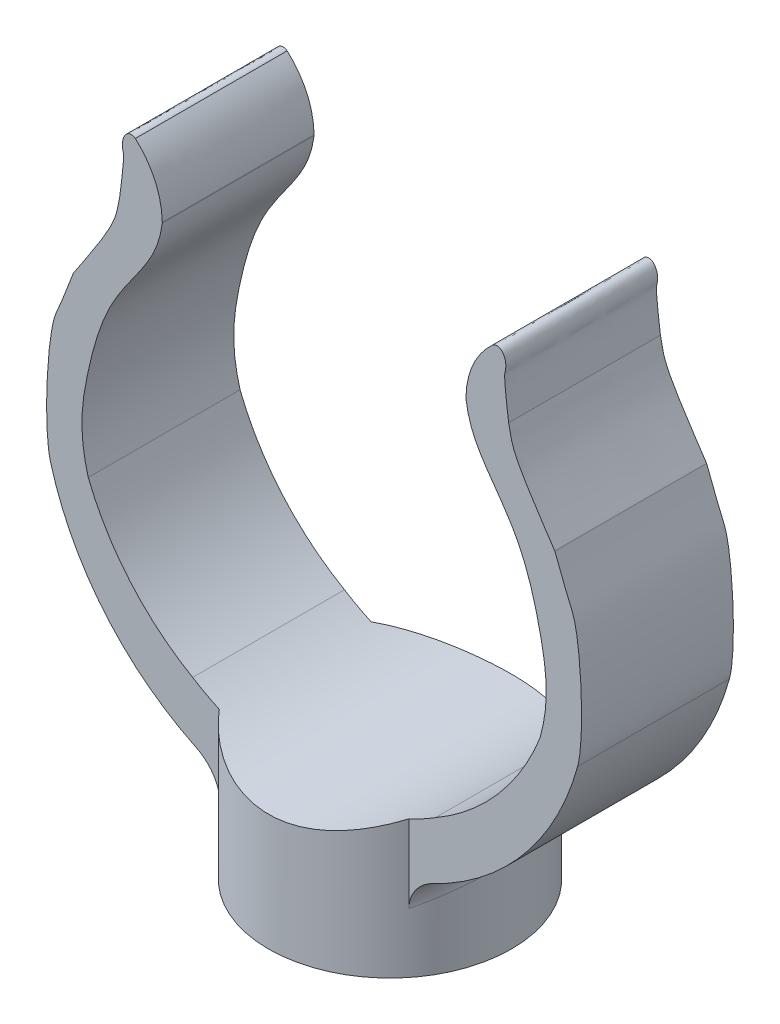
ISO-10303-21;
HEADER;
FILE_DESCRIPTION(('STEP AP214'),'2;1');
FILE_NAME('part.step','',(''),(''),'','','');
FILE_SCHEMA(('AUTOMOTIVE_DESIGN { 1 0 10303 214 1 1 1 1 }'));
ENDSEC;
DATA;
#1=APPLICATION_CONTEXT('core data for automotive mechanical design processes');
#2=APPLICATION_PROTOCOL_DEFINITION('international standard','automotive_design',2000,#1);
#3=PRODUCT_CONTEXT('',#1,'mechanical');
#4=PRODUCT('Part','Part','',(#3));
#5=PRODUCT_RELATED_PRODUCT_CATEGORY('part','',(#4));
#6=PRODUCT_DEFINITION_FORMATION('','',#4);
#7=PRODUCT_DEFINITION_CONTEXT('part definition',#1,'design');
#8=PRODUCT_DEFINITION('design','',#6,#7);
#9=PRODUCT_DEFINITION_SHAPE('','',#8);
#10=(LENGTH_UNIT() NAMED_UNIT(*) SI_UNIT(.MILLI.,.METRE.));
#11=(NAMED_UNIT(*) PLANE_ANGLE_UNIT() SI_UNIT($,.RADIAN.));
#12=(NAMED_UNIT(*) SI_UNIT($,.STERADIAN.) SOLID_ANGLE_UNIT());
#13=UNCERTAINTY_MEASURE_WITH_UNIT(LENGTH_MEASURE(1.E-05),#10,'distance_accuracy_value','');
#14=(GEOMETRIC_REPRESENTATION_CONTEXT(3) GLOBAL_UNCERTAINTY_ASSIGNED_CONTEXT((#13)) GLOBAL_UNIT_ASSIGNED_CONTEXT((#10,
#11,#12)) REPRESENTATION_CONTEXT('',''));
#15=CARTESIAN_POINT('',(0.,0.,0.));
#16=DIRECTION('',(0.,0.,1.));
#17=DIRECTION('',(1.,0.,0.));
#18=AXIS2_PLACEMENT_3D('',#15,#16,#17);
#19=CARTESIAN_POINT('',(0.,14.5,5.));
#20=DIRECTION('',(0.,0.,-1.));
#21=DIRECTION('',(-1.,0.,0.));
#22=AXIS2_PLACEMENT_3D('',#19,#20,#21);
#23=CYLINDRICAL_SURFACE('',#22,18.);
#24=CARTESIAN_POINT('',(0.,14.5,5.));
#25=DIRECTION('',(0.,0.,1.));
#26=DIRECTION('',(1.,0.,0.));
#27=AXIS2_PLACEMENT_3D('',#24,#25,#26);
#28=CIRCLE('',#27,18.);
#29=CARTESIAN_POINT('',(7.79422863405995,-1.72498073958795,5.));
#30=VERTEX_POINT('',#29);
#31=CARTESIAN_POINT('',(17.359175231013,9.73984923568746,5.));
#32=VERTEX_POINT('',#31);
#33=EDGE_CURVE('E584',#30,#32,#28,.T.);
#34=ORIENTED_EDGE('',*,*,#33,.F.);
#35=CARTESIAN_POINT('',(4.00065850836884,-3.04977867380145,8.9577011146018));
#36=CARTESIAN_POINT('',(3.23152912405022,-3.22510988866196,7.32724647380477));
#37=CARTESIAN_POINT('',(3.55614089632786,-4.9997540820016,7.16616089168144));
#38=CARTESIAN_POINT('',(4.20987776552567,-3.00209520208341,8.84233499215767));
#39=CARTESIAN_POINT('',(3.41101180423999,-3.19380906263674,7.24860698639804));
#40=CARTESIAN_POINT('',(3.74211356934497,-4.94677244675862,7.07386799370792));
#41=CARTESIAN_POINT('',(4.41441762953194,-2.95152043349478,8.71828266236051));
#42=CARTESIAN_POINT('',(3.58978117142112,-3.15976036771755,7.16237696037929));
#43=CARTESIAN_POINT('',(3.92392678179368,-4.89057825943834,6.97462612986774));
#44=CARTESIAN_POINT('',(4.81328792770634,-2.8457416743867,8.45366726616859));
#45=CARTESIAN_POINT('',(3.9427963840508,-3.08691965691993,6.97500516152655));
#46=CARTESIAN_POINT('',(4.27847815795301,-4.77304630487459,6.76293381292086));
#47=CARTESIAN_POINT('',(5.00762250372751,-2.79053958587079,8.31311097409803));
#48=CARTESIAN_POINT('',(4.11697550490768,-3.04820010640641,6.87407781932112));
#49=CARTESIAN_POINT('',(4.45122000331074,-4.71171065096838,6.65048877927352));
#50=CARTESIAN_POINT('',(5.57398407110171,-2.61975193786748,7.8680690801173));
#51=CARTESIAN_POINT('',(4.62810621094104,-2.92641293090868,6.5505321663));
#52=CARTESIAN_POINT('',(4.95465250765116,-4.52194659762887,6.29445526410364));
#53=CARTESIAN_POINT('',(5.92971537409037,-2.49890287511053,7.54001810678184));
#54=CARTESIAN_POINT('',(4.95922782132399,-2.83674817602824,6.30482771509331));
#55=CARTESIAN_POINT('',(5.270858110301,-4.38766986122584,6.0320144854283));
#56=CARTESIAN_POINT('',(6.62418787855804,-2.24129265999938,6.79295766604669));
#57=CARTESIAN_POINT('',(5.61643803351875,-2.63899105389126,5.72858930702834));
#58=CARTESIAN_POINT('',(5.88816700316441,-4.10143628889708,5.43436613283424));
#59=CARTESIAN_POINT('',(6.95770103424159,-2.10414614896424,6.36814103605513));
#60=CARTESIAN_POINT('',(5.9405807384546,-2.52990667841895,5.39270189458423));
#61=CARTESIAN_POINT('',(6.18462314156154,-3.94905127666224,5.09451282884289));
#62=CARTESIAN_POINT('',(7.55775972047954,-1.83976678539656,5.45887335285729));
#63=CARTESIAN_POINT('',(6.53045673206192,-2.31435240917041,4.65677251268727));
#64=CARTESIAN_POINT('',(6.71800864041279,-3.65529642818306,4.36709868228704));
#65=CARTESIAN_POINT('',(7.82423203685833,-1.71254487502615,4.97435795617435));
#66=CARTESIAN_POINT('',(6.79808171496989,-2.20754431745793,4.25695352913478));
#67=CARTESIAN_POINT('',(6.95487292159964,-3.51393874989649,3.97948636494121));
#68=CARTESIAN_POINT('',(8.16977982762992,-1.53969624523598,4.20516400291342));
#69=CARTESIAN_POINT('',(7.1481845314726,-2.05998540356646,3.61078313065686));
#70=CARTESIAN_POINT('',(7.26202651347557,-3.32188471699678,3.36413120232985));
#71=CARTESIAN_POINT('',(8.27686919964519,-1.48453471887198,3.93826296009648));
#72=CARTESIAN_POINT('',(7.25704128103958,-2.01257291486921,3.38578702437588));
#73=CARTESIAN_POINT('',(7.35721706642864,-3.26059413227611,3.15061036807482));
#74=CARTESIAN_POINT('',(8.47009395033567,-1.38299146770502,3.3933214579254));
#75=CARTESIAN_POINT('',(7.45394376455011,-1.92484183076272,2.92402117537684));
#76=CARTESIAN_POINT('',(7.528972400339,-3.14776829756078,2.71465716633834));
#77=CARTESIAN_POINT('',(8.55624044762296,-1.33660508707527,3.11528700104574));
#78=CARTESIAN_POINT('',(7.54227475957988,-1.88441236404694,2.68703370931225));
#79=CARTESIAN_POINT('',(7.6055470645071,-3.09622787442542,2.49222960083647));
#80=CARTESIAN_POINT('',(8.70629174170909,-1.25461176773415,2.55083310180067));
#81=CARTESIAN_POINT('',(7.69632329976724,-1.81271783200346,2.20415802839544));
#82=CARTESIAN_POINT('',(7.73892599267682,-3.00512418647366,2.04066648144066));
#83=CARTESIAN_POINT('',(8.77025628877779,-1.21897590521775,2.26443847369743));
#84=CARTESIAN_POINT('',(7.76233717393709,-1.78132591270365,1.95798970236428));
#85=CARTESIAN_POINT('',(7.79578336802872,-2.96552878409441,1.81155077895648));
#86=CARTESIAN_POINT('',(8.87527428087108,-1.15992227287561,1.68512799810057));
#87=CARTESIAN_POINT('',(7.87072523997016,-1.72924141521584,1.45899607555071));
#88=CARTESIAN_POINT('',(7.88913269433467,-2.89991363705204,1.34810239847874));
#89=CARTESIAN_POINT('',(8.91634388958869,-1.13649588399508,1.39221690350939));
#90=CARTESIAN_POINT('',(7.91329506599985,-1.70845783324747,1.20579574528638));
#91=CARTESIAN_POINT('',(7.92563901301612,-2.87388431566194,1.11377352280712));
#92=CARTESIAN_POINT('',(8.96626253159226,-1.10790390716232,0.889918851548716));
#93=CARTESIAN_POINT('',(7.96500795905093,-1.68309280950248,0.771147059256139));
#94=CARTESIAN_POINT('',(7.97001113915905,-2.84211545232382,0.711935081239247));
#95=CARTESIAN_POINT('',(8.98105008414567,-1.09938587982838,0.681467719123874));
#96=CARTESIAN_POINT('',(7.98034923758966,-1.67552016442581,0.59055599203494));
#97=CARTESIAN_POINT('',(7.98315563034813,-2.83265097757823,0.54517417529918));
#98=CARTESIAN_POINT('',(8.99883774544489,-1.089131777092,0.263717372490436));
#99=CARTESIAN_POINT('',(7.99879040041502,-1.66640955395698,0.228629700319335));
#100=CARTESIAN_POINT('',(7.99896688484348,-2.82125753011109,0.210973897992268));
#101=CARTESIAN_POINT('',(9.00183702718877,-1.08739617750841,0.0544180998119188));
#102=CARTESIAN_POINT('',(8.0019055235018,-1.66486406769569,0.0471371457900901));
#103=CARTESIAN_POINT('',(8.0016329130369,-2.81932908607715,0.0435344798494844));
#104=CARTESIAN_POINT('',(8.99527180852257,-1.09118758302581,-0.41671761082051));
#105=CARTESIAN_POINT('',(7.99509523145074,-1.66823525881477,-0.361175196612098));
#106=CARTESIAN_POINT('',(7.99579716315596,-2.82354175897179,-0.333374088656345));
#107=CARTESIAN_POINT('',(8.98234672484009,-1.09865731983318,-0.6784868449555));
#108=CARTESIAN_POINT('',(7.98167124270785,-1.6748857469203,-0.588145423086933));
#109=CARTESIAN_POINT('',(7.98430819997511,-2.83184146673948,-0.542789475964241));
#110=CARTESIAN_POINT('',(8.93811749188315,-1.12404215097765,-1.19957436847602));
#111=CARTESIAN_POINT('',(7.93585321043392,-1.6974104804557,-1.03913828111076));
#112=CARTESIAN_POINT('',(7.94499332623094,-2.86004683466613,-0.959659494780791));
#113=CARTESIAN_POINT('',(8.90680437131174,-1.14196234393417,-1.45889139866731));
#114=CARTESIAN_POINT('',(7.90338775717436,-1.71331961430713,-1.26345997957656));
#115=CARTESIAN_POINT('',(7.91715944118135,-2.87995815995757,-1.16711311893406));
#116=CARTESIAN_POINT('',(8.82615379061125,-1.18761146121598,-1.9733800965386));
#117=CARTESIAN_POINT('',(7.82004861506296,-1.75366027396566,-1.70729765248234));
#118=CARTESIAN_POINT('',(7.8454700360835,-2.93067940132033,-1.57870407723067));
#119=CARTESIAN_POINT('',(8.77678745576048,-1.21535609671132,-2.22854443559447));
#120=CARTESIAN_POINT('',(7.76903633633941,-1.77815709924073,-1.92707867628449));
#121=CARTESIAN_POINT('',(7.80158884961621,-2.96150677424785,-1.78283554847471));
#122=CARTESIAN_POINT('',(8.66062476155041,-1.27966978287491,-2.73262020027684));
#123=CARTESIAN_POINT('',(7.64948736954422,-1.8346179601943,-2.3596658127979));
#124=CARTESIAN_POINT('',(7.698333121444,-3.03296642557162,-2.18609616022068));
#125=CARTESIAN_POINT('',(8.59382068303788,-1.31624274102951,-2.98152880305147));
#126=CARTESIAN_POINT('',(7.58079493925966,-1.86665172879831,-2.57270310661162));
#127=CARTESIAN_POINT('',(7.63895171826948,-3.07360304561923,-2.38522304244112));
#128=CARTESIAN_POINT('',(8.44397271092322,-1.39674508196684,-3.4699614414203));
#129=CARTESIAN_POINT('',(7.427451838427,-1.93667579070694,-2.98881285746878));
#130=CARTESIAN_POINT('',(7.50575352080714,-3.16305009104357,-2.77596915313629));
#131=CARTESIAN_POINT('',(8.36103079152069,-1.44062803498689,-3.70953361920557));
#132=CARTESIAN_POINT('',(7.34272524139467,-1.97470168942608,-3.19212871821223));
#133=CARTESIAN_POINT('',(7.43202737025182,-3.21180892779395,-2.96762689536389));
#134=CARTESIAN_POINT('',(8.17940114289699,-1.53458285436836,-4.17967697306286));
#135=CARTESIAN_POINT('',(7.15820788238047,-2.05547210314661,-3.58893816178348));
#136=CARTESIAN_POINT('',(7.27057879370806,-3.31620317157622,-3.34374157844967));
#137=CARTESIAN_POINT('',(8.08070771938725,-1.58465695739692,-4.41024485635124));
#138=CARTESIAN_POINT('',(7.05822227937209,-2.09828890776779,-3.78255813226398));
#139=CARTESIAN_POINT('',(7.18285130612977,-3.3718410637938,-3.52819588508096));
#140=CARTESIAN_POINT('',(7.76215840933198,-1.74207538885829,-5.08672551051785));
#141=CARTESIAN_POINT('',(6.7363235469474,-2.23212959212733,-4.34897695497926));
#142=CARTESIAN_POINT('',(6.89969636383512,-3.54675043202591,-4.06938040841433));
#143=CARTESIAN_POINT('',(7.5197449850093,-1.85666562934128,-5.51770077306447));
#144=CARTESIAN_POINT('',(6.4935815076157,-2.3279697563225,-4.70379572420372));
#145=CARTESIAN_POINT('',(6.68421776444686,-3.67407292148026,-4.41416061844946));
#146=CARTESIAN_POINT('',(6.95752642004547,-2.10405631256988,-6.36704016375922));
#147=CARTESIAN_POINT('',(5.94064634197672,-2.52972161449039,-5.39146075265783));
#148=CARTESIAN_POINT('',(6.18446792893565,-3.94895145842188,-5.09363213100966));
#149=CARTESIAN_POINT('',(6.63288469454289,-2.23757635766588,-6.78119539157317));
#150=CARTESIAN_POINT('',(5.62519674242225,-2.63592566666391,-5.71900881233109));
#151=CARTESIAN_POINT('',(5.89589750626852,-4.09730706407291,-5.42495631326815));
#152=CARTESIAN_POINT('',(6.10352072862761,-2.4346561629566,-7.354156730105));
#153=CARTESIAN_POINT('',(5.12604911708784,-2.78675298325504,-6.15944926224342));
#154=CARTESIAN_POINT('',(5.42535175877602,-4.31628462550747,-5.88332538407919));
#155=CARTESIAN_POINT('',(5.92005740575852,-2.49979797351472,-7.53705341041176));
#156=CARTESIAN_POINT('',(4.95382135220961,-2.83598650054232,-6.29872576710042));
#157=CARTESIAN_POINT('',(5.26227324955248,-4.3886644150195,-6.02964272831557));
#158=CARTESIAN_POINT('',(5.53970713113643,-2.62751948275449,-7.88594515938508));
#159=CARTESIAN_POINT('',(4.6010604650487,-2.9308480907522,-6.56093312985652));
#160=CARTESIAN_POINT('',(4.92418411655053,-4.53057720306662,-6.30875612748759));
#161=CARTESIAN_POINT('',(5.34281976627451,-2.69009910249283,-8.05193970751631));
#162=CARTESIAN_POINT('',(4.42045794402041,-2.97642859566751,-6.68366013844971));
#163=CARTESIAN_POINT('',(4.74917312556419,-4.60011011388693,-6.44155176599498));
#164=CARTESIAN_POINT('',(5.13958981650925,-2.75064104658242,-8.2090447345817));
#165=CARTESIAN_POINT('',(4.2376447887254,-3.01936308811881,-6.79741345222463));
#166=CARTESIAN_POINT('',(4.56852428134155,-4.66737894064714,-6.56723578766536));
#167=(BOUNDED_SURFACE() B_SPLINE_SURFACE(3,2,((#35,#36,#37),(#38,#39,#40),(#41,#42,#43),(#44,
#45,#46),(#47,#48,#49),(#50,#51,#52),(#53,#54,#55),(#56,#57,#58),(#59,#60,#61),(#62,#63,#64),
(#65,#66,#67),(#68,#69,#70),(#71,#72,#73),(#74,#75,#76),(#77,#78,#79),(#80,#81,#82),(#83,#84,
#85),(#86,#87,#88),(#89,#90,#91),(#92,#93,#94),(#95,#96,#97),(#98,#99,#100),(#101,#102,#103),
(#104,#105,#106),(#107,#108,#109),(#110,#111,#112),(#113,#114,#115),(#116,#117,#118),(#119,#120,
#121),(#122,#123,#124),(#125,#126,#127),(#128,#129,#130),(#131,#132,#133),(#134,#135,#136),
(#137,#138,#139),(#140,#141,#142),(#143,#144,#145),(#146,#147,#148),(#149,#150,#151),(#152,#153,
#154),(#155,#156,#157),(#158,#159,#160),(#161,#162,#163),(#164,#165,#166)),.UNSPECIFIED.,.F.,
.F.,.F.) B_SPLINE_SURFACE_WITH_KNOTS((4,2,2,2,2,2,2,2,2,2,2,2,2,2,2,2,2,2,2,2,2,4),(3,3),(0.,
0.794151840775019,1.58797884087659,3.17432721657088,4.91880081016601,6.66517132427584,
7.55986684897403,8.4540863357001,9.34587805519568,10.2370393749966,10.8644638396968,
11.4919323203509,12.2777031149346,13.0638575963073,13.8512750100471,14.6390415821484,
15.4219831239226,16.2052083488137,17.7707480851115,19.4697802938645,20.3188133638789,
21.1678725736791),(0.,1.),
.UNSPECIFIED.) GEOMETRIC_REPRESENTATION_ITEM() RATIONAL_B_SPLINE_SURFACE(((1.,0.741214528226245,
1.),(1.,0.744699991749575,1.),(1.,0.748356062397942,1.),(1.,0.755907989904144,1.),(1.,
0.759803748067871,1.),(1.,0.771696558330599,1.),(1.,0.779905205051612,1.),(1.,0.796932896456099,
1.),(1.,0.805731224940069,1.),(1.,0.82224430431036,1.),(1.,0.829957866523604,1.),(1.,
0.840222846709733,1.),(1.,0.843457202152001,1.),(1.,0.849356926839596,1.),(1.,0.852022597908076,
1.),(1.,0.856701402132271,1.),(1.,0.858716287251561,1.),(1.,0.862040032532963,1.),(1.,
0.863349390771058,1.),(1.,0.864944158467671,1.),(1.,0.865417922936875,1.),(1.,0.865988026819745,
1.),(1.,0.86608433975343,1.),(1.,0.865873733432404,1.),(1.,0.865458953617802,1.),(1.,
0.864044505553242,1.),(1.,0.863044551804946,1.),(1.,0.860483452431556,1.),(1.,0.858921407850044,
1.),(1.,0.855274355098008,1.),(1.,0.853189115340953,1.),(1.,0.848558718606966,1.),(1.,
0.846016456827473,1.),(1.,0.840518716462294,1.),(1.,0.837563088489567,1.),(1.,0.828166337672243,
1.),(1.,0.821192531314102,1.),(1.,0.805732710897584,1.),(1.,0.797168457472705,1.),(1.,
0.784156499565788,1.),(1.,0.779792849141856,1.),(1.,0.771119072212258,1.),(1.,0.766808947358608,
1.),(1.,0.7625804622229,1.))) REPRESENTATION_ITEM('') SURFACE());
#168=CARTESIAN_POINT('',(4.00065850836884,-3.04977867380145,8.9577011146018));
#169=CARTESIAN_POINT('',(4.20987776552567,-3.00209520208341,8.84233499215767));
#170=CARTESIAN_POINT('',(4.41441762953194,-2.95152043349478,8.71828266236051));
#171=CARTESIAN_POINT('',(4.81328792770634,-2.8457416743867,8.45366726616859));
#172=CARTESIAN_POINT('',(5.00762250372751,-2.79053958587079,8.31311097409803));
#173=CARTESIAN_POINT('',(5.57398407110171,-2.61975193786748,7.8680690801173));
#174=CARTESIAN_POINT('',(5.92971537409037,-2.49890287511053,7.54001810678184));
#175=CARTESIAN_POINT('',(6.62418787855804,-2.24129265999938,6.79295766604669));
#176=CARTESIAN_POINT('',(6.95770103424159,-2.10414614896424,6.36814103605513));
#177=CARTESIAN_POINT('',(7.55775972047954,-1.83976678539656,5.45887335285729));
#178=CARTESIAN_POINT('',(7.82423203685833,-1.71254487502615,4.97435795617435));
#179=CARTESIAN_POINT('',(8.16977982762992,-1.53969624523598,4.20516400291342));
#180=CARTESIAN_POINT('',(8.27686919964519,-1.48453471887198,3.93826296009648));
#181=CARTESIAN_POINT('',(8.47009395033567,-1.38299146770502,3.3933214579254));
#182=CARTESIAN_POINT('',(8.55624044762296,-1.33660508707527,3.11528700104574));
#183=CARTESIAN_POINT('',(8.70629174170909,-1.25461176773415,2.55083310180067));
#184=CARTESIAN_POINT('',(8.77025628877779,-1.21897590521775,2.26443847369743));
#185=CARTESIAN_POINT('',(8.87527428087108,-1.15992227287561,1.68512799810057));
#186=CARTESIAN_POINT('',(8.91634388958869,-1.13649588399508,1.39221690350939));
#187=CARTESIAN_POINT('',(8.96626253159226,-1.10790390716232,0.889918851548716));
#188=CARTESIAN_POINT('',(8.98105008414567,-1.09938587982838,0.681467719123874));
#189=CARTESIAN_POINT('',(8.99883774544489,-1.089131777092,0.263717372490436));
#190=CARTESIAN_POINT('',(9.00183702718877,-1.08739617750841,0.0544180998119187));
#191=CARTESIAN_POINT('',(8.99527180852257,-1.09118758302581,-0.41671761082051));
#192=CARTESIAN_POINT('',(8.98234672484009,-1.09865731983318,-0.6784868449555));
#193=CARTESIAN_POINT('',(8.93811749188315,-1.12404215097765,-1.19957436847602));
#194=CARTESIAN_POINT('',(8.90680437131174,-1.14196234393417,-1.45889139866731));
#195=CARTESIAN_POINT('',(8.82615379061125,-1.18761146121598,-1.9733800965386));
#196=CARTESIAN_POINT('',(8.77678745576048,-1.21535609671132,-2.22854443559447));
#197=CARTESIAN_POINT('',(8.66062476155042,-1.27966978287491,-2.73262020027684));
#198=CARTESIAN_POINT('',(8.59382068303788,-1.31624274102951,-2.98152880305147));
#199=CARTESIAN_POINT('',(8.44397271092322,-1.39674508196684,-3.4699614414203));
#200=CARTESIAN_POINT('',(8.36103079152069,-1.44062803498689,-3.70953361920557));
#201=CARTESIAN_POINT('',(8.17940114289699,-1.53458285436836,-4.17967697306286));
#202=CARTESIAN_POINT('',(8.08070771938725,-1.58465695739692,-4.41024485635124));
#203=CARTESIAN_POINT('',(7.76215840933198,-1.74207538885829,-5.08672551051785));
#204=CARTESIAN_POINT('',(7.5197449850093,-1.85666562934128,-5.51770077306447));
#205=CARTESIAN_POINT('',(6.95752642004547,-2.10405631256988,-6.36704016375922));
#206=CARTESIAN_POINT('',(6.6328846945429,-2.23757635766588,-6.78119539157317));
#207=CARTESIAN_POINT('',(6.10352072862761,-2.4346561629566,-7.354156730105));
#208=CARTESIAN_POINT('',(5.92005740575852,-2.49979797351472,-7.53705341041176));
#209=CARTESIAN_POINT('',(5.53970713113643,-2.62751948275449,-7.88594515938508));
#210=CARTESIAN_POINT('',(5.34281976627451,-2.69009910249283,-8.05193970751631));
#211=CARTESIAN_POINT('',(5.13958981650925,-2.75064104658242,-8.2090447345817));
#212=B_SPLINE_CURVE_WITH_KNOTS('',3,(#168,#169,#170,#171,#172,#173,#174,#175,#176,#177,#178,
#179,#180,#181,#182,#183,#184,#185,#186,#187,#188,#189,#190,#191,#192,#193,#194,#195,#196,#197,
#198,#199,#200,#201,#202,#203,#204,#205,#206,#207,#208,#209,#210,#211),.UNSPECIFIED.,.F.,.F.,(4,
2,2,2,2,2,2,2,2,2,2,2,2,2,2,2,2,2,2,2,2,4),(0.,0.794151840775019,1.58797884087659,
3.17432721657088,4.91880081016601,6.66517132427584,7.55986684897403,8.4540863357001,
9.34587805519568,10.2370393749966,10.8644638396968,11.4919323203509,12.2777031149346,
13.0638575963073,13.8512750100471,14.6390415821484,15.4219831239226,16.2052083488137,
17.7707480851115,19.4697802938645,20.3188133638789,21.1678725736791),.UNSPECIFIED.);
#213=CARTESIAN_POINT('',(7.79422863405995,-1.72498073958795,-5.));
#214=VERTEX_POINT('',#213);
#215=EDGE_CURVE('E432',#30,#214,#212,.T.);
#216=ORIENTED_EDGE('',*,*,#215,.T.);
#217=CARTESIAN_POINT('',(0.,14.5,-5.));
#218=DIRECTION('',(0.,0.,1.));
#219=DIRECTION('',(1.,0.,0.));
#220=AXIS2_PLACEMENT_3D('',#217,#218,#219);
#221=CIRCLE('',#220,18.);
#222=CARTESIAN_POINT('',(17.359175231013,9.73984923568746,-5.));
#223=VERTEX_POINT('',#222);
#224=EDGE_CURVE('E512',#214,#223,#221,.T.);
#225=ORIENTED_EDGE('',*,*,#224,.T.);
#226=DIRECTION('',(0.,0.,-1.));
#227=VECTOR('',#226,1.);
#228=CARTESIAN_POINT('',(17.359175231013,9.73984923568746,5.));
#229=LINE('',#228,#227);
#230=EDGE_CURVE('E338',#32,#223,#229,.T.);
#231=ORIENTED_EDGE('',*,*,#230,.F.);
#232=EDGE_LOOP('',(#34,#216,#225,#231));
#233=FACE_BOUND('',#232,.T.);
#234=ADVANCED_FACE('F63',(#233),#23,.T.);
#235=CARTESIAN_POINT('',(0.,16.,5.));
#236=DIRECTION('',(0.,0.,-1.));
#237=DIRECTION('',(-1.,0.,0.));
#238=AXIS2_PLACEMENT_3D('',#235,#236,#237);
#239=CYLINDRICAL_SURFACE('',#238,16.);
#240=DIRECTION('',(0.,0.,1.));
#241=VECTOR('',#240,1.);
#242=CARTESIAN_POINT('',(8.,2.14359353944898,-10.));
#243=LINE('',#242,#241);
#244=CARTESIAN_POINT('',(8.,2.14359353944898,-5.));
#245=VERTEX_POINT('',#244);
#246=CARTESIAN_POINT('',(8.,2.14359353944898,5.));
#247=VERTEX_POINT('',#246);
#248=EDGE_CURVE('E217',#245,#247,#243,.T.);
#249=ORIENTED_EDGE('',*,*,#248,.T.);
#250=CARTESIAN_POINT('',(0.,16.,5.));
#251=DIRECTION('',(0.,0.,1.));
#252=DIRECTION('',(1.,0.,0.));
#253=AXIS2_PLACEMENT_3D('',#250,#251,#252);
#254=CIRCLE('',#253,16.);
#255=CARTESIAN_POINT('',(14.8765736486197,10.1103857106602,5.));
#256=VERTEX_POINT('',#255);
#257=EDGE_CURVE('E635',#247,#256,#254,.T.);
#258=ORIENTED_EDGE('',*,*,#257,.T.);
#259=DIRECTION('',(0.,0.,-1.));
#260=VECTOR('',#259,1.);
#261=CARTESIAN_POINT('',(14.8765736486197,10.1103857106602,5.));
#262=LINE('',#261,#260);
#263=CARTESIAN_POINT('',(14.8765736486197,10.1103857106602,-5.));
#264=VERTEX_POINT('',#263);
#265=EDGE_CURVE('E244',#256,#264,#262,.T.);
#266=ORIENTED_EDGE('',*,*,#265,.T.);
#267=CARTESIAN_POINT('',(0.,16.,-5.));
#268=DIRECTION('',(0.,0.,1.));
#269=DIRECTION('',(1.,0.,0.));
#270=AXIS2_PLACEMENT_3D('',#267,#268,#269);
#271=CIRCLE('',#270,16.);
#272=EDGE_CURVE('E234',#245,#264,#271,.T.);
#273=ORIENTED_EDGE('',*,*,#272,.F.);
#274=EDGE_LOOP('',(#249,#258,#266,#273));
#275=FACE_BOUND('',#274,.T.);
#276=ADVANCED_FACE('F242',(#275),#239,.F.);
#277=CARTESIAN_POINT('',(-17.4824299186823,15.7749857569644,5.));
#278=DIRECTION('',(0.,0.,1.));
#279=DIRECTION('',(1.,0.,0.));
#280=AXIS2_PLACEMENT_3D('',#277,#278,#279);
#281=PLANE('',#280);
#282=CARTESIAN_POINT('',(0.,14.8321710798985,5.));
#283=DIRECTION('',(0.,0.,1.));
#284=DIRECTION('',(1.,0.,0.));
#285=AXIS2_PLACEMENT_3D('',#282,#283,#284);
#286=CIRCLE('',#285,15.);
#287=CARTESIAN_POINT('',(6.2449979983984,1.19398938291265,5.));
#288=VERTEX_POINT('',#287);
#289=EDGE_CURVE('E223',#288,#247,#286,.T.);
#290=ORIENTED_EDGE('',*,*,#289,.F.);
#291=DIRECTION('',(0.,1.,0.));
#292=VECTOR('',#291,1.);
#293=CARTESIAN_POINT('',(6.2449979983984,2.14359353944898,5.));
#294=LINE('',#293,#292);
#295=CARTESIAN_POINT('',(6.2449979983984,-3.91364982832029,5.));
#296=VERTEX_POINT('',#295);
#297=EDGE_CURVE('E456',#288,#296,#294,.F.);
#298=ORIENTED_EDGE('',*,*,#297,.T.);
#299=CARTESIAN_POINT('',(6.2449979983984,-3.91364982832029,5.));
#300=CARTESIAN_POINT('',(6.24502755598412,-3.79599860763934,5.));
#301=CARTESIAN_POINT('',(6.25722605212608,-3.67901953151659,5.));
#302=CARTESIAN_POINT('',(6.30211563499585,-3.45001066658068,5.));
#303=CARTESIAN_POINT('',(6.33462995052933,-3.33794701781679,5.));
#304=CARTESIAN_POINT('',(6.42528500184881,-3.09670846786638,5.));
#305=CARTESIAN_POINT('',(6.48744910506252,-2.96907966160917,5.));
#306=CARTESIAN_POINT('',(6.63180877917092,-2.72518804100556,5.));
#307=CARTESIAN_POINT('',(6.71408629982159,-2.60897452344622,5.));
#308=CARTESIAN_POINT('',(6.89610513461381,-2.38867236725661,5.));
#309=CARTESIAN_POINT('',(6.99605973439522,-2.28476115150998,5.));
#310=CARTESIAN_POINT('',(7.20975353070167,-2.09271684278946,5.));
#311=CARTESIAN_POINT('',(7.32346013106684,-2.00454762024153,5.));
#312=CARTESIAN_POINT('',(7.49905264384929,-1.88774899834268,5.));
#313=CARTESIAN_POINT('',(7.55650563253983,-1.85230935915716,5.));
#314=CARTESIAN_POINT('',(7.67369624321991,-1.7855293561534,5.));
#315=CARTESIAN_POINT('',(7.73343236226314,-1.75418635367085,5.));
#316=CARTESIAN_POINT('',(7.79422863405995,-1.72498073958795,5.));
#317=B_SPLINE_CURVE_WITH_KNOTS('',3,(#299,#300,#301,#302,#303,#304,#305,#306,#307,#308,#309,
#310,#311,#312,#313,#314,#315,#316),.UNSPECIFIED.,.F.,.F.,(4,2,2,2,2,2,2,2,4),(0.,
0.351352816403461,0.699690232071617,1.12342057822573,1.54890701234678,1.97992924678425,
2.40994915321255,2.61232349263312,2.81456683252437),.UNSPECIFIED.);
#318=EDGE_CURVE('E449',#296,#30,#317,.T.);
#319=ORIENTED_EDGE('',*,*,#318,.T.);
#320=ORIENTED_EDGE('',*,*,#33,.T.);
#321=CARTESIAN_POINT('',(15.8578860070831,21.276446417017,5.));
#322=CARTESIAN_POINT('',(16.5447494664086,19.4169828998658,5.));
#323=CARTESIAN_POINT('',(16.9469278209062,18.638172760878,5.));
#324=CARTESIAN_POINT('',(17.5753133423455,16.6257272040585,5.));
#325=CARTESIAN_POINT('',(17.8234613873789,11.4329940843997,5.));
#326=CARTESIAN_POINT('',(17.359175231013,9.73984923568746,5.));
#327=B_SPLINE_CURVE_WITH_KNOTS('',3,(#321,#322,#323,#324,#325,#326),.UNSPECIFIED.,.F.,.F.,(4,1,
1,4),(0.,0.210543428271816,0.310543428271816,1.),.UNSPECIFIED.);
#328=CARTESIAN_POINT('',(15.8578860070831,21.276446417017,5.));
#329=VERTEX_POINT('',#328);
#330=EDGE_CURVE('E583',#329,#32,#327,.T.);
#331=ORIENTED_EDGE('',*,*,#330,.F.);
#332=CARTESIAN_POINT('',(15.8578860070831,21.276446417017,5.));
#333=CARTESIAN_POINT('',(15.8529690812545,21.2897574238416,5.));
#334=CARTESIAN_POINT('',(12.727655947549,25.8904531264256,5.));
#335=CARTESIAN_POINT('',(13.0472231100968,26.1852481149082,5.));
#336=CARTESIAN_POINT('',(12.8140673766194,27.0712399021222,5.));
#337=B_SPLINE_CURVE_WITH_KNOTS('',3,(#332,#333,#334,#335,#336),.UNSPECIFIED.,.F.,.F.,(4,1,4),
(0.213455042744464,0.458677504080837,1.),.UNSPECIFIED.);
#338=CARTESIAN_POINT('',(12.8140673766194,27.0712399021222,5.));
#339=VERTEX_POINT('',#338);
#340=EDGE_CURVE('E690',#329,#339,#337,.T.);
#341=ORIENTED_EDGE('',*,*,#340,.T.);
#342=CARTESIAN_POINT('',(12.8140673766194,27.0712399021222,5.));
#343=CARTESIAN_POINT('',(12.8128371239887,27.0938160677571,5.));
#344=CARTESIAN_POINT('',(12.4846058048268,29.4980849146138,5.));
#345=CARTESIAN_POINT('',(12.6157061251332,29.9656127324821,5.));
#346=CARTESIAN_POINT('',(12.703970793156,30.6748549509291,5.));
#347=CARTESIAN_POINT('',(12.1896302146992,31.2685160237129,5.));
#348=CARTESIAN_POINT('',(11.7725887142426,31.,5.));
#349=B_SPLINE_CURVE_WITH_KNOTS('',3,(#342,#343,#344,#345,#346,#347,#348),.UNSPECIFIED.,.F.,.F.,
(4,1,1,1,4),(0.,0.319811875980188,0.380234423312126,0.604225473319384,1.),.UNSPECIFIED.);
#350=CARTESIAN_POINT('',(11.7725887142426,31.,5.));
#351=VERTEX_POINT('',#350);
#352=EDGE_CURVE('E677',#339,#351,#349,.T.);
#353=ORIENTED_EDGE('',*,*,#352,.T.);
#354=CARTESIAN_POINT('',(10.,27.1012239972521,5.));
#355=CARTESIAN_POINT('',(10.056682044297,29.4109177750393,5.));
#356=CARTESIAN_POINT('',(11.7725887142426,31.,5.));
#357=B_SPLINE_CURVE_WITH_KNOTS('',2,(#354,#355,#356),.UNSPECIFIED.,.F.,.F.,(3,3),(0.,1.),.UNSPECIFIED.);
#358=CARTESIAN_POINT('',(10.,27.1012239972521,5.));
#359=VERTEX_POINT('',#358);
#360=EDGE_CURVE('E570',#359,#351,#357,.T.);
#361=ORIENTED_EDGE('',*,*,#360,.F.);
#362=DIRECTION('',(0.,1.,0.));
#363=VECTOR('',#362,1.);
#364=CARTESIAN_POINT('',(10.,27.0512239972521,5.));
#365=LINE('',#364,#363);
#366=CARTESIAN_POINT('',(10.,27.0512239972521,5.));
#367=VERTEX_POINT('',#366);
#368=EDGE_CURVE('E564',#367,#359,#365,.T.);
#369=ORIENTED_EDGE('',*,*,#368,.F.);
#370=CARTESIAN_POINT('',(10.,27.0512239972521,5.));
#371=CARTESIAN_POINT('',(10.1980247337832,25.5293091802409,5.));
#372=CARTESIAN_POINT('',(11.3560800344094,23.666593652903,5.));
#373=CARTESIAN_POINT('',(13.7924749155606,20.4581965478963,5.));
#374=CARTESIAN_POINT('',(15.1848372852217,15.3822849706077,5.));
#375=CARTESIAN_POINT('',(15.5244188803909,12.4083406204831,5.));
#376=CARTESIAN_POINT('',(14.8765736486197,10.1103857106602,5.));
#377=B_SPLINE_CURVE_WITH_KNOTS('',3,(#370,#371,#372,#373,#374,#375,#376),.UNSPECIFIED.,.F.,.F.,
(4,1,1,1,4),(0.,0.203211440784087,0.376639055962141,0.640999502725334,1.),.UNSPECIFIED.);
#378=EDGE_CURVE('E642',#367,#256,#377,.T.);
#379=ORIENTED_EDGE('',*,*,#378,.T.);
#380=ORIENTED_EDGE('',*,*,#257,.F.);
#381=EDGE_LOOP('',(#290,#298,#319,#320,#331,#341,#353,#361,#369,#379,#380));
#382=FACE_BOUND('',#381,.T.);
#383=ADVANCED_FACE('F384',(#382),#281,.T.);
#384=CARTESIAN_POINT('',(-17.4824299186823,15.7749857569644,-5.));
#385=DIRECTION('',(0.,0.,1.));
#386=DIRECTION('',(1.,0.,0.));
#387=AXIS2_PLACEMENT_3D('',#384,#385,#386);
#388=PLANE('',#387);
#389=DIRECTION('',(0.,1.,0.));
#390=VECTOR('',#389,1.);
#391=CARTESIAN_POINT('',(6.2449979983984,2.14359353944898,-5.));
#392=LINE('',#391,#390);
#393=CARTESIAN_POINT('',(6.2449979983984,1.19398938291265,-5.));
#394=VERTEX_POINT('',#393);
#395=CARTESIAN_POINT('',(6.2449979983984,-3.91364982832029,-5.));
#396=VERTEX_POINT('',#395);
#397=EDGE_CURVE('E237',#394,#396,#392,.F.);
#398=ORIENTED_EDGE('',*,*,#397,.F.);
#399=CARTESIAN_POINT('',(0.,14.8321710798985,-5.));
#400=DIRECTION('',(0.,0.,1.));
#401=DIRECTION('',(1.,0.,0.));
#402=AXIS2_PLACEMENT_3D('',#399,#400,#401);
#403=CIRCLE('',#402,15.);
#404=EDGE_CURVE('E220',#394,#245,#403,.T.);
#405=ORIENTED_EDGE('',*,*,#404,.T.);
#406=ORIENTED_EDGE('',*,*,#272,.T.);
#407=CARTESIAN_POINT('',(10.,27.0512239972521,-5.));
#408=CARTESIAN_POINT('',(10.1980247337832,25.5293091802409,-5.));
#409=CARTESIAN_POINT('',(11.3560800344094,23.666593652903,-5.));
#410=CARTESIAN_POINT('',(13.7924749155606,20.4581965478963,-5.));
#411=CARTESIAN_POINT('',(15.1848372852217,15.3822849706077,-5.));
#412=CARTESIAN_POINT('',(15.5244188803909,12.4083406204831,-5.));
#413=CARTESIAN_POINT('',(14.8765736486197,10.1103857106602,-5.));
#414=B_SPLINE_CURVE_WITH_KNOTS('',3,(#407,#408,#409,#410,#411,#412,#413),.UNSPECIFIED.,.F.,.F.,
(4,1,1,1,4),(0.,0.203211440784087,0.376639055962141,0.640999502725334,1.),.UNSPECIFIED.);
#415=CARTESIAN_POINT('',(10.,27.0512239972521,-5.));
#416=VERTEX_POINT('',#415);
#417=EDGE_CURVE('E248',#416,#264,#414,.T.);
#418=ORIENTED_EDGE('',*,*,#417,.F.);
#419=DIRECTION('',(0.,1.,0.));
#420=VECTOR('',#419,1.);
#421=CARTESIAN_POINT('',(10.,27.0512239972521,-5.));
#422=LINE('',#421,#420);
#423=CARTESIAN_POINT('',(10.,27.1012239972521,-5.));
#424=VERTEX_POINT('',#423);
#425=EDGE_CURVE('E255',#416,#424,#422,.T.);
#426=ORIENTED_EDGE('',*,*,#425,.T.);
#427=CARTESIAN_POINT('',(10.,27.1012239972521,-5.));
#428=CARTESIAN_POINT('',(10.056682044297,29.4109177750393,-5.));
#429=CARTESIAN_POINT('',(11.7725887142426,31.,-5.));
#430=B_SPLINE_CURVE_WITH_KNOTS('',2,(#427,#428,#429),.UNSPECIFIED.,.F.,.F.,(3,3),(0.,1.),.UNSPECIFIED.);
#431=CARTESIAN_POINT('',(11.7725887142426,31.,-5.));
#432=VERTEX_POINT('',#431);
#433=EDGE_CURVE('E542',#424,#432,#430,.T.);
#434=ORIENTED_EDGE('',*,*,#433,.T.);
#435=CARTESIAN_POINT('',(12.8140673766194,27.0712399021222,-5.));
#436=CARTESIAN_POINT('',(12.8128371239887,27.0938160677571,-5.));
#437=CARTESIAN_POINT('',(12.4846058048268,29.4980849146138,-5.));
#438=CARTESIAN_POINT('',(12.6157061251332,29.9656127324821,-5.));
#439=CARTESIAN_POINT('',(12.703970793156,30.6748549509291,-5.));
#440=CARTESIAN_POINT('',(12.1896302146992,31.2685160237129,-5.));
#441=CARTESIAN_POINT('',(11.7725887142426,31.,-5.));
#442=B_SPLINE_CURVE_WITH_KNOTS('',3,(#435,#436,#437,#438,#439,#440,#441),.UNSPECIFIED.,.F.,.F.,
(4,1,1,1,4),(0.,0.319811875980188,0.380234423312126,0.604225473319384,1.),.UNSPECIFIED.);
#443=CARTESIAN_POINT('',(12.8140673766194,27.0712399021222,-5.));
#444=VERTEX_POINT('',#443);
#445=EDGE_CURVE('E533',#444,#432,#442,.T.);
#446=ORIENTED_EDGE('',*,*,#445,.F.);
#447=CARTESIAN_POINT('',(15.8578860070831,21.276446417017,-5.));
#448=CARTESIAN_POINT('',(15.8529690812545,21.2897574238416,-5.));
#449=CARTESIAN_POINT('',(12.727655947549,25.8904531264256,-5.));
#450=CARTESIAN_POINT('',(13.0472231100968,26.1852481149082,-5.));
#451=CARTESIAN_POINT('',(12.8140673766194,27.0712399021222,-5.));
#452=B_SPLINE_CURVE_WITH_KNOTS('',3,(#447,#448,#449,#450,#451),.UNSPECIFIED.,.F.,.F.,(4,1,4),
(0.213455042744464,0.458677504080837,1.),.UNSPECIFIED.);
#453=CARTESIAN_POINT('',(15.8578860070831,21.276446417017,-5.));
#454=VERTEX_POINT('',#453);
#455=EDGE_CURVE('E525',#454,#444,#452,.T.);
#456=ORIENTED_EDGE('',*,*,#455,.F.);
#457=CARTESIAN_POINT('',(15.8578860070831,21.276446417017,-5.));
#458=CARTESIAN_POINT('',(16.5447494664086,19.4169828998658,-5.));
#459=CARTESIAN_POINT('',(16.9469278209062,18.638172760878,-5.));
#460=CARTESIAN_POINT('',(17.5753133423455,16.6257272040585,-5.));
#461=CARTESIAN_POINT('',(17.8234613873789,11.4329940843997,-5.));
#462=CARTESIAN_POINT('',(17.359175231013,9.73984923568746,-5.));
#463=B_SPLINE_CURVE_WITH_KNOTS('',3,(#457,#458,#459,#460,#461,#462),.UNSPECIFIED.,.F.,.F.,(4,1,
1,4),(0.,0.210543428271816,0.310543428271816,1.),.UNSPECIFIED.);
#464=EDGE_CURVE('E519',#454,#223,#463,.T.);
#465=ORIENTED_EDGE('',*,*,#464,.T.);
#466=ORIENTED_EDGE('',*,*,#224,.F.);
#467=CARTESIAN_POINT('',(7.79422863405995,-1.72498073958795,-5.));
#468=CARTESIAN_POINT('',(7.7177892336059,-1.76171685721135,-5.));
#469=CARTESIAN_POINT('',(7.64304053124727,-1.80180336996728,-5.));
#470=CARTESIAN_POINT('',(7.49730769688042,-1.88831577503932,-5.));
#471=CARTESIAN_POINT('',(7.42632344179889,-1.93474145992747,-5.));
#472=CARTESIAN_POINT('',(7.21879951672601,-2.08355219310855,-5.));
#473=CARTESIAN_POINT('',(7.08856856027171,-2.19504454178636,-5.));
#474=CARTESIAN_POINT('',(6.91104024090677,-2.3760378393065,-5.));
#475=CARTESIAN_POINT('',(6.85550084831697,-2.43769599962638,-5.));
#476=CARTESIAN_POINT('',(6.75001276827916,-2.56561710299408,-5.));
#477=CARTESIAN_POINT('',(6.70006427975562,-2.63188020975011,-5.));
#478=CARTESIAN_POINT('',(6.55978698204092,-2.83688475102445,-5.));
#479=CARTESIAN_POINT('',(6.47863363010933,-2.98223692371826,-5.));
#480=CARTESIAN_POINT('',(6.36957023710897,-3.23730620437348,-5.));
#481=CARTESIAN_POINT('',(6.33292896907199,-3.34334787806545,-5.));
#482=CARTESIAN_POINT('',(6.27746146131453,-3.55981306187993,-5.));
#483=CARTESIAN_POINT('',(6.25856303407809,-3.67021689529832,-5.));
#484=CARTESIAN_POINT('',(6.24671413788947,-3.82535024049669,-5.));
#485=CARTESIAN_POINT('',(6.24498689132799,-3.8694989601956,-5.));
#486=CARTESIAN_POINT('',(6.2449979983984,-3.91364982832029,-5.));
#487=B_SPLINE_CURVE_WITH_KNOTS('',3,(#467,#468,#469,#470,#471,#472,#473,#474,#475,#476,#477,
#478,#479,#480,#481,#482,#483,#484,#485,#486),.UNSPECIFIED.,.F.,.F.,(4,2,2,2,2,2,2,2,2,4),(0.,
0.254204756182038,0.50840119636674,1.0196904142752,1.26838454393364,1.517087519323,
2.01284325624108,2.34829039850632,2.68236676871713,2.81480424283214),.UNSPECIFIED.);
#488=EDGE_CURVE('E460',#214,#396,#487,.T.);
#489=ORIENTED_EDGE('',*,*,#488,.T.);
#490=EDGE_LOOP('',(#398,#405,#406,#418,#426,#434,#446,#456,#465,#466,#489));
#491=FACE_BOUND('',#490,.T.);
#492=ADVANCED_FACE('F232',(#491),#388,.F.);
#493=DIRECTION('',(0.,0.,-1.));
#494=VECTOR('',#493,1.);
#495=SURFACE_OF_LINEAR_EXTRUSION('',#327,#494);
#496=ORIENTED_EDGE('',*,*,#464,.F.);
#497=DIRECTION('',(0.,0.,-1.));
#498=VECTOR('',#497,1.);
#499=CARTESIAN_POINT('',(15.8578860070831,21.276446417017,5.));
#500=LINE('',#499,#498);
#501=EDGE_CURVE('E335',#329,#454,#500,.T.);
#502=ORIENTED_EDGE('',*,*,#501,.F.);
#503=ORIENTED_EDGE('',*,*,#330,.T.);
#504=ORIENTED_EDGE('',*,*,#230,.T.);
#505=EDGE_LOOP('',(#496,#502,#503,#504));
#506=FACE_BOUND('',#505,.T.);
#507=ADVANCED_FACE('F418',(#506),#495,.T.);
#508=DIRECTION('',(0.,0.,-1.));
#509=VECTOR('',#508,1.);
#510=SURFACE_OF_LINEAR_EXTRUSION('',#337,#509);
#511=ORIENTED_EDGE('',*,*,#455,.T.);
#512=DIRECTION('',(0.,0.,-1.));
#513=VECTOR('',#512,1.);
#514=CARTESIAN_POINT('',(12.8140673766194,27.0712399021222,5.));
#515=LINE('',#514,#513);
#516=EDGE_CURVE('E331',#339,#444,#515,.T.);
#517=ORIENTED_EDGE('',*,*,#516,.F.);
#518=ORIENTED_EDGE('',*,*,#340,.F.);
#519=ORIENTED_EDGE('',*,*,#501,.T.);
#520=EDGE_LOOP('',(#511,#517,#518,#519));
#521=FACE_BOUND('',#520,.T.);
#522=ADVANCED_FACE('F706',(#521),#510,.F.);
#523=DIRECTION('',(0.,0.,-1.));
#524=VECTOR('',#523,1.);
#525=SURFACE_OF_LINEAR_EXTRUSION('',#349,#524);
#526=ORIENTED_EDGE('',*,*,#445,.T.);
#527=DIRECTION('',(0.,0.,-1.));
#528=VECTOR('',#527,1.);
#529=CARTESIAN_POINT('',(11.7725887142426,31.,5.));
#530=LINE('',#529,#528);
#531=EDGE_CURVE('E328',#351,#432,#530,.T.);
#532=ORIENTED_EDGE('',*,*,#531,.F.);
#533=ORIENTED_EDGE('',*,*,#352,.F.);
#534=ORIENTED_EDGE('',*,*,#516,.T.);
#535=EDGE_LOOP('',(#526,#532,#533,#534));
#536=FACE_BOUND('',#535,.T.);
#537=ADVANCED_FACE('F573',(#536),#525,.F.);
#538=DIRECTION('',(0.,0.,-1.));
#539=VECTOR('',#538,1.);
#540=SURFACE_OF_LINEAR_EXTRUSION('',#357,#539);
#541=ORIENTED_EDGE('',*,*,#433,.F.);
#542=DIRECTION('',(0.,0.,-1.));
#543=VECTOR('',#542,1.);
#544=CARTESIAN_POINT('',(10.,27.1012239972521,5.));
#545=LINE('',#544,#543);
#546=EDGE_CURVE('E325',#359,#424,#545,.T.);
#547=ORIENTED_EDGE('',*,*,#546,.F.);
#548=ORIENTED_EDGE('',*,*,#360,.T.);
#549=ORIENTED_EDGE('',*,*,#531,.T.);
#550=EDGE_LOOP('',(#541,#547,#548,#549));
#551=FACE_BOUND('',#550,.T.);
#552=ADVANCED_FACE('F568',(#551),#540,.T.);
#553=CARTESIAN_POINT('',(10.,27.0512239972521,5.));
#554=DIRECTION('',(-1.,0.,0.));
#555=DIRECTION('',(0.,0.,1.));
#556=AXIS2_PLACEMENT_3D('',#553,#554,#555);
#557=PLANE('',#556);
#558=ORIENTED_EDGE('',*,*,#425,.F.);
#559=DIRECTION('',(0.,0.,-1.));
#560=VECTOR('',#559,1.);
#561=CARTESIAN_POINT('',(10.,27.0512239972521,5.));
#562=LINE('',#561,#560);
#563=EDGE_CURVE('E322',#367,#416,#562,.T.);
#564=ORIENTED_EDGE('',*,*,#563,.F.);
#565=ORIENTED_EDGE('',*,*,#368,.T.);
#566=ORIENTED_EDGE('',*,*,#546,.T.);
#567=EDGE_LOOP('',(#558,#564,#565,#566));
#568=FACE_BOUND('',#567,.T.);
#569=ADVANCED_FACE('F560',(#568),#557,.T.);
#570=DIRECTION('',(0.,0.,-1.));
#571=VECTOR('',#570,1.);
#572=SURFACE_OF_LINEAR_EXTRUSION('',#377,#571);
#573=ORIENTED_EDGE('',*,*,#417,.T.);
#574=ORIENTED_EDGE('',*,*,#265,.F.);
#575=ORIENTED_EDGE('',*,*,#378,.F.);
#576=ORIENTED_EDGE('',*,*,#563,.T.);
#577=EDGE_LOOP('',(#573,#574,#575,#576));
#578=FACE_BOUND('',#577,.T.);
#579=ADVANCED_FACE('F381',(#578),#572,.F.);
#580=CARTESIAN_POINT('',(0.,2.14359353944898,0.));
#581=DIRECTION('',(0.,1.,0.));
#582=DIRECTION('',(-1.,0.,0.));
#583=AXIS2_PLACEMENT_3D('',#580,#581,#582);
#584=CYLINDRICAL_SURFACE('',#583,8.);
#585=CARTESIAN_POINT('',(4.56852428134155,-4.66737894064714,-6.56723578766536));
#586=CARTESIAN_POINT('',(4.74917312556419,-4.60011011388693,-6.44155176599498));
#587=CARTESIAN_POINT('',(4.92418411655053,-4.53057720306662,-6.30875612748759));
#588=CARTESIAN_POINT('',(5.26227324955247,-4.3886644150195,-6.02964272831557));
#589=CARTESIAN_POINT('',(5.42535175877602,-4.31628462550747,-5.88332538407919));
#590=CARTESIAN_POINT('',(5.89589750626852,-4.09730706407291,-5.42495631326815));
#591=CARTESIAN_POINT('',(6.18446792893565,-3.94895145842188,-5.09363213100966));
#592=CARTESIAN_POINT('',(6.68421776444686,-3.67407292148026,-4.41416061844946));
#593=CARTESIAN_POINT('',(6.89969636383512,-3.54675043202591,-4.06938040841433));
#594=CARTESIAN_POINT('',(7.18285130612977,-3.3718410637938,-3.52819588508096));
#595=CARTESIAN_POINT('',(7.27057879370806,-3.31620317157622,-3.34374157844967));
#596=CARTESIAN_POINT('',(7.43202737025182,-3.21180892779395,-2.96762689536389));
#597=CARTESIAN_POINT('',(7.50575352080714,-3.16305009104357,-2.77596915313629));
#598=CARTESIAN_POINT('',(7.63895171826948,-3.07360304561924,-2.38522304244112));
#599=CARTESIAN_POINT('',(7.698333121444,-3.03296642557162,-2.18609616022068));
#600=CARTESIAN_POINT('',(7.80158884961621,-2.96150677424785,-1.78283554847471));
#601=CARTESIAN_POINT('',(7.8454700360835,-2.93067940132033,-1.57870407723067));
#602=CARTESIAN_POINT('',(7.91715944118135,-2.87995815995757,-1.16711311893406));
#603=CARTESIAN_POINT('',(7.94499332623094,-2.86004683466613,-0.959659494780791));
#604=CARTESIAN_POINT('',(7.98430819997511,-2.83184146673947,-0.542789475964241));
#605=CARTESIAN_POINT('',(7.99579716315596,-2.82354175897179,-0.333374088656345));
#606=CARTESIAN_POINT('',(8.0016329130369,-2.81932908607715,0.0435344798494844));
#607=CARTESIAN_POINT('',(7.99896688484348,-2.82125753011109,0.210973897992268));
#608=CARTESIAN_POINT('',(7.98315563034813,-2.83265097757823,0.54517417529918));
#609=CARTESIAN_POINT('',(7.97001113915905,-2.84211545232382,0.711935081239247));
#610=CARTESIAN_POINT('',(7.92563901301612,-2.87388431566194,1.11377352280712));
#611=CARTESIAN_POINT('',(7.88913269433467,-2.89991363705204,1.34810239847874));
#612=CARTESIAN_POINT('',(7.79578336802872,-2.96552878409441,1.81155077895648));
#613=CARTESIAN_POINT('',(7.73892599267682,-3.00512418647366,2.04066648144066));
#614=CARTESIAN_POINT('',(7.6055470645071,-3.09622787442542,2.49222960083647));
#615=CARTESIAN_POINT('',(7.528972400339,-3.14776829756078,2.71465716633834));
#616=CARTESIAN_POINT('',(7.35721706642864,-3.26059413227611,3.15061036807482));
#617=CARTESIAN_POINT('',(7.26202651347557,-3.32188471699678,3.36413120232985));
#618=CARTESIAN_POINT('',(6.95487292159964,-3.51393874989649,3.97948636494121));
#619=CARTESIAN_POINT('',(6.71800864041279,-3.65529642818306,4.36709868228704));
#620=CARTESIAN_POINT('',(6.18462314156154,-3.94905127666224,5.09451282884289));
#621=CARTESIAN_POINT('',(5.88816700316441,-4.10143628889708,5.43436613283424));
#622=CARTESIAN_POINT('',(5.27085811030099,-4.38766986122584,6.0320144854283));
#623=CARTESIAN_POINT('',(4.95465250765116,-4.52194659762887,6.29445526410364));
#624=CARTESIAN_POINT('',(4.45122000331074,-4.71171065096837,6.65048877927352));
#625=CARTESIAN_POINT('',(4.27847815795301,-4.77304630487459,6.76293381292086));
#626=CARTESIAN_POINT('',(3.92392678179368,-4.89057825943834,6.97462612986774));
#627=CARTESIAN_POINT('',(3.74211356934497,-4.94677244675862,7.07386799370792));
#628=CARTESIAN_POINT('',(3.55614089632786,-4.9997540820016,7.16616089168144));
#629=B_SPLINE_CURVE_WITH_KNOTS('',3,(#585,#586,#587,#588,#589,#590,#591,#592,#593,#594,#595,
#596,#597,#598,#599,#600,#601,#602,#603,#604,#605,#606,#607,#608,#609,#610,#611,#612,#613,#614,
#615,#616,#617,#618,#619,#620,#621,#622,#623,#624,#625,#626,#627,#628),.UNSPECIFIED.,.F.,.F.,(4,
2,2,2,2,2,2,2,2,2,2,2,2,2,2,2,2,2,2,2,2,4),(0.,0.849059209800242,1.69809227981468,
3.39712448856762,4.96266422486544,5.7458894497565,6.52883099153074,7.31659756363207,
8.10401497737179,8.89016945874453,9.67594025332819,10.3034087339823,10.9308331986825,
11.8219945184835,12.713786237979,13.6080057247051,14.5027012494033,16.2490717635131,
17.9935453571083,19.5798937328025,20.3737207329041,21.1678725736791),.UNSPECIFIED.);
#630=EDGE_CURVE('E365',#396,#296,#629,.T.);
#631=ORIENTED_EDGE('',*,*,#630,.T.);
#632=ORIENTED_EDGE('',*,*,#297,.F.);
#633=CARTESIAN_POINT('',(-7.99999999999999,2.14359353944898,0.));
#634=CARTESIAN_POINT('',(-8.0000008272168,2.14359455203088,-0.206280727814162));
#635=CARTESIAN_POINT('',(-7.99201174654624,2.13854661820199,-0.412552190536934));
#636=CARTESIAN_POINT('',(-7.96017537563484,2.1185578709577,-0.823459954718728));
#637=CARTESIAN_POINT('',(-7.93632212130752,2.10361333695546,-1.02809561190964));
#638=CARTESIAN_POINT('',(-7.87306095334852,2.06438777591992,-1.43430299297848));
#639=CARTESIAN_POINT('',(-7.83363262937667,2.04009449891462,-1.63587033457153));
#640=CARTESIAN_POINT('',(-7.73973085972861,1.98306302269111,-2.0343271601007));
#641=CARTESIAN_POINT('',(-7.68525075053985,1.95032108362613,-2.23121453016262));
#642=CARTESIAN_POINT('',(-7.56228385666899,1.87775414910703,-2.61777402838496));
#643=CARTESIAN_POINT('',(-7.49388888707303,1.83797579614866,-2.80748425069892));
#644=CARTESIAN_POINT('',(-7.3435222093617,1.75240939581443,-3.18010557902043));
#645=CARTESIAN_POINT('',(-7.26154553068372,1.70661914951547,-3.36301416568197));
#646=CARTESIAN_POINT('',(-7.0846895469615,1.61032201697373,-3.72116109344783));
#647=CARTESIAN_POINT('',(-6.9898120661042,1.55981579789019,-3.89640051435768));
#648=CARTESIAN_POINT('',(-6.78781438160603,1.45537985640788,-4.23852477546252));
#649=CARTESIAN_POINT('',(-6.68069376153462,1.40145001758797,-4.40540933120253));
#650=CARTESIAN_POINT('',(-6.32032913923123,1.22596544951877,-4.92349422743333));
#651=CARTESIAN_POINT('',(-6.04463813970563,1.10016554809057,-5.25820159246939));
#652=CARTESIAN_POINT('',(-5.59347847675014,0.913130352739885,-5.72362528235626));
#653=CARTESIAN_POINT('',(-5.43671146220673,0.851024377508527,-5.8727421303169));
#654=CARTESIAN_POINT('',(-5.11109924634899,0.728736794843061,-6.15820501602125));
#655=CARTESIAN_POINT('',(-4.94225210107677,0.668555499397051,-6.29454899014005));
#656=CARTESIAN_POINT('',(-4.57935642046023,0.546899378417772,-6.56388302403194));
#657=CARTESIAN_POINT('',(-4.3843718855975,0.48570382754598,-6.69573942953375));
#658=CARTESIAN_POINT('',(-3.98237404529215,0.368960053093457,-6.94235290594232));
#659=CARTESIAN_POINT('',(-3.77536600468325,0.313409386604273,-7.05711738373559));
#660=CARTESIAN_POINT('',(-3.35057394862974,0.209536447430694,-7.26841855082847));
#661=CARTESIAN_POINT('',(-3.13279317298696,0.161212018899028,-7.36496067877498));
#662=CARTESIAN_POINT('',(-2.68795642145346,0.0732325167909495,-7.53869236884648));
#663=CARTESIAN_POINT('',(-2.46090159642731,0.0335763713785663,-7.61588432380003));
#664=CARTESIAN_POINT('',(-2.01763632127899,-0.033068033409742,-7.74455376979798));
#665=CARTESIAN_POINT('',(-1.80198906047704,-0.0608102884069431,-7.79758248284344));
#666=CARTESIAN_POINT('',(-1.36607301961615,-0.107101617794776,-7.88563729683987));
#667=CARTESIAN_POINT('',(-1.14580446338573,-0.125651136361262,-7.92066426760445));
#668=CARTESIAN_POINT('',(-0.702641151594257,-0.153006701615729,-7.97220359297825));
#669=CARTESIAN_POINT('',(-0.479748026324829,-0.161818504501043,-7.98872688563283));
#670=CARTESIAN_POINT('',(-0.0331964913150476,-0.169453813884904,-8.00304874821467));
#671=CARTESIAN_POINT('',(0.190461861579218,-0.168278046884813,-8.00084868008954));
#672=CARTESIAN_POINT('',(0.614471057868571,-0.156587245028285,-7.97890621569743));
#673=CARTESIAN_POINT('',(0.814941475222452,-0.14700639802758,-7.96091846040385));
#674=CARTESIAN_POINT('',(1.2134408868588,-0.120000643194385,-7.90998778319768));
#675=CARTESIAN_POINT('',(1.41146986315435,-0.102575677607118,-7.87704475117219));
#676=CARTESIAN_POINT('',(1.80372417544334,-0.0602933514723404,-7.79658046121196));
#677=CARTESIAN_POINT('',(1.99794954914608,-0.0354360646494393,-7.74905934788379));
#678=CARTESIAN_POINT('',(2.3813778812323,0.0211412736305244,-7.63994618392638));
#679=CARTESIAN_POINT('',(2.57058064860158,0.0528615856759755,-7.57835359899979));
#680=CARTESIAN_POINT('',(2.94506910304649,0.122879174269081,-7.44088782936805));
#681=CARTESIAN_POINT('',(3.1302827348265,0.161249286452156,-7.36485549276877));
#682=CARTESIAN_POINT('',(3.49352300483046,0.243475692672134,-7.19966295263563));
#683=CARTESIAN_POINT('',(3.67154724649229,0.287333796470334,-7.11049841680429));
#684=CARTESIAN_POINT('',(4.19348838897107,0.42578541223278,-6.82436502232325));
#685=CARTESIAN_POINT('',(4.52549971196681,0.52730016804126,-6.60867258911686));
#686=CARTESIAN_POINT('',(5.1845632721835,0.751907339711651,-6.10810196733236));
#687=CARTESIAN_POINT('',(5.50754077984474,0.876145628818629,-5.81837198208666));
#688=CARTESIAN_POINT('',(5.95360340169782,1.06333724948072,-5.34803157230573));
#689=CARTESIAN_POINT('',(6.0959904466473,1.1259247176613,-5.18514684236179));
#690=CARTESIAN_POINT('',(6.36737369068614,1.24987489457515,-4.84802585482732));
#691=CARTESIAN_POINT('',(6.49636768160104,1.31123740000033,-4.6737877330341));
#692=CARTESIAN_POINT('',(6.74990405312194,1.43589085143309,-4.30043007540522));
#693=CARTESIAN_POINT('',(6.87327380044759,1.49894619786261,-4.10043408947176));
#694=CARTESIAN_POINT('',(7.10248719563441,1.61962220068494,-3.68918108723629));
#695=CARTESIAN_POINT('',(7.20833872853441,1.67724529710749,-3.47792919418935));
#696=CARTESIAN_POINT('',(7.40146247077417,1.78492693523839,-3.04539119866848));
#697=CARTESIAN_POINT('',(7.48874671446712,1.834990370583,-2.82411170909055));
#698=CARTESIAN_POINT('',(7.64370915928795,1.92551463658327,-2.37288542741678));
#699=CARTESIAN_POINT('',(7.71139038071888,1.96597694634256,-2.14293997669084));
#700=CARTESIAN_POINT('',(7.82145437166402,2.03261443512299,-1.69517317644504));
#701=CARTESIAN_POINT('',(7.86544291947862,2.05968175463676,-1.47787960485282));
#702=CARTESIAN_POINT('',(7.93530677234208,2.10296812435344,-1.03932304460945));
#703=CARTESIAN_POINT('',(7.96118319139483,2.11918784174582,-0.818060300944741));
#704=CARTESIAN_POINT('',(7.99436472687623,2.14002706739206,-0.37378308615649));
#705=CARTESIAN_POINT('',(8.00168522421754,2.14465618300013,-0.150770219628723));
#706=CARTESIAN_POINT('',(7.99766461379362,2.14212098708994,0.29500878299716));
#707=CARTESIAN_POINT('',(7.9863252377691,2.13495776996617,0.517774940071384));
#708=CARTESIAN_POINT('',(7.94793800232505,2.11090149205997,0.931405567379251));
#709=CARTESIAN_POINT('',(7.92318043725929,2.09542951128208,1.12257174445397));
#710=CARTESIAN_POINT('',(7.86010987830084,2.05641087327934,1.50187997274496));
#711=CARTESIAN_POINT('',(7.82179249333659,2.03286160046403,1.69002102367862));
#712=CARTESIAN_POINT('',(7.73205060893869,1.97845023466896,2.06204037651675));
#713=CARTESIAN_POINT('',(7.68062708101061,1.94758868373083,2.24591899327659));
#714=CARTESIAN_POINT('',(7.56517167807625,1.87946220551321,2.60852435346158));
#715=CARTESIAN_POINT('',(7.50113476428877,1.84219471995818,2.78724900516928));
#716=CARTESIAN_POINT('',(7.35794410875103,1.76053223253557,3.14637080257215));
#717=CARTESIAN_POINT('',(7.27825059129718,1.71589633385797,3.32649758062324));
#718=CARTESIAN_POINT('',(7.10633908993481,1.62196524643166,3.67946985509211));
#719=CARTESIAN_POINT('',(7.01411693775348,1.57266850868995,3.85231290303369));
#720=CARTESIAN_POINT('',(6.81773611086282,1.47063232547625,4.19006493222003));
#721=CARTESIAN_POINT('',(6.7135746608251,1.41789208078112,4.35497205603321));
#722=CARTESIAN_POINT('',(6.49387939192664,1.31017050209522,4.67626027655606));
#723=CARTESIAN_POINT('',(6.37834479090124,1.25518901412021,4.83264078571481));
#724=CARTESIAN_POINT('',(6.11858240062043,1.13595763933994,5.15873689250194));
#725=CARTESIAN_POINT('',(5.97263494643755,1.07153553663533,5.32702338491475));
#726=CARTESIAN_POINT('',(5.66717190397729,0.942944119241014,5.65090431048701));
#727=CARTESIAN_POINT('',(5.50765574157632,0.87877481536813,5.80649820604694));
#728=CARTESIAN_POINT('',(5.17570667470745,0.752269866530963,6.10424347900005));
#729=CARTESIAN_POINT('',(5.00326794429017,0.689935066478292,6.24638872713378));
#730=CARTESIAN_POINT('',(4.64630001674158,0.568671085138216,6.51628490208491));
#731=CARTESIAN_POINT('',(4.46176926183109,0.509742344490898,6.64403396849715));
#732=CARTESIAN_POINT('',(4.07354485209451,0.394410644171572,6.88920293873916));
#733=CARTESIAN_POINT('',(3.86937210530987,0.338217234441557,7.00596502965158));
#734=CARTESIAN_POINT('',(3.45019516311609,0.23275910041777,7.22161153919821));
#735=CARTESIAN_POINT('',(3.23519617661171,0.183491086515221,7.32050445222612));
#736=CARTESIAN_POINT('',(2.79586603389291,0.0933318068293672,7.4992893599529));
#737=CARTESIAN_POINT('',(2.57153999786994,0.0524360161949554,7.57919162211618));
#738=CARTESIAN_POINT('',(2.11523636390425,-0.0197345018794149,7.71898236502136));
#739=CARTESIAN_POINT('',(1.88325983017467,-0.0510105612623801,7.77887361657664));
#740=CARTESIAN_POINT('',(1.43696201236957,-0.100359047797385,7.87285751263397));
#741=CARTESIAN_POINT('',(1.22316354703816,-0.119431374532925,7.90891578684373));
#742=CARTESIAN_POINT('',(0.792732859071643,-0.148419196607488,7.96358123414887));
#743=CARTESIAN_POINT('',(0.576100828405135,-0.158335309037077,7.98218958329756));
#744=CARTESIAN_POINT('',(0.141899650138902,-0.168729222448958,8.00169215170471));
#745=CARTESIAN_POINT('',(-0.0756691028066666,-0.169210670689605,8.00259321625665));
#746=CARTESIAN_POINT('',(-0.509967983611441,-0.160730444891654,7.98668535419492));
#747=CARTESIAN_POINT('',(-0.726698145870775,-0.151769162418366,7.96987716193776));
#748=CARTESIAN_POINT('',(-1.13993624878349,-0.125765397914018,7.92087442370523));
#749=CARTESIAN_POINT('',(-1.33665343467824,-0.109440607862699,7.89004465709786));
#750=CARTESIAN_POINT('',(-1.72658766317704,-0.0694166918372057,7.81398520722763));
#751=CARTESIAN_POINT('',(-1.91980350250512,-0.0457150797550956,7.76875066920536));
#752=CARTESIAN_POINT('',(-2.30138685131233,0.00851600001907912,7.66438096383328));
#753=CARTESIAN_POINT('',(-2.48975583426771,0.0390433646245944,7.60525007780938));
#754=CARTESIAN_POINT('',(-2.86070279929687,0.106277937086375,7.47362893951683));
#755=CARTESIAN_POINT('',(-3.04327852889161,0.142987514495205,7.40113356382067));
#756=CARTESIAN_POINT('',(-3.40831874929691,0.223284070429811,7.24048335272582));
#757=CARTESIAN_POINT('',(-3.59052521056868,0.267076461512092,7.15184538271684));
#758=CARTESIAN_POINT('',(-3.94680147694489,0.359553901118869,6.96157753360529));
#759=CARTESIAN_POINT('',(-4.12086828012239,0.408240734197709,6.85994291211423));
#760=CARTESIAN_POINT('',(-4.46007274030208,0.509493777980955,6.64440643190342));
#761=CARTESIAN_POINT('',(-4.62520918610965,0.562060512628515,6.53050291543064));
#762=CARTESIAN_POINT('',(-4.94589577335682,0.670012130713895,6.29111749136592));
#763=CARTESIAN_POINT('',(-5.10144513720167,0.725397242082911,6.16563464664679));
#764=CARTESIAN_POINT('',(-5.41899884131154,0.844095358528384,5.88927069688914));
#765=CARTESIAN_POINT('',(-5.57982089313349,0.907608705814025,5.73711495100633));
#766=CARTESIAN_POINT('',(-5.88822197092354,1.03518961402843,5.42012453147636));
#767=CARTESIAN_POINT('',(-6.03579980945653,1.0992572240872,5.25528872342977));
#768=CARTESIAN_POINT('',(-6.31714795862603,1.22638194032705,4.91352052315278));
#769=CARTESIAN_POINT('',(-6.45090273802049,1.28943784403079,4.7365748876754));
#770=CARTESIAN_POINT('',(-6.70365634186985,1.41275352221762,4.37153004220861));
#771=CARTESIAN_POINT('',(-6.82265601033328,1.47301345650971,4.18343147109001));
#772=CARTESIAN_POINT('',(-7.05111918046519,1.59211050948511,3.78641838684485));
#773=CARTESIAN_POINT('',(-7.1597181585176,1.65069416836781,3.5769282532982));
#774=CARTESIAN_POINT('',(-7.35859675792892,1.76067612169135,3.14754436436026));
#775=CARTESIAN_POINT('',(-7.44887326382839,1.81207319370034,2.92764884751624));
#776=CARTESIAN_POINT('',(-7.60975396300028,1.90544361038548,2.47954511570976));
#777=CARTESIAN_POINT('',(-7.68041349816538,1.94744339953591,2.2513623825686));
#778=CARTESIAN_POINT('',(-7.80129547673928,2.0202708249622,1.7880295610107));
#779=CARTESIAN_POINT('',(-7.85153144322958,2.05110585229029,1.55288419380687));
#780=CARTESIAN_POINT('',(-7.92721566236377,2.09792408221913,1.09883121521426));
#781=CARTESIAN_POINT('',(-7.95446803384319,2.11498244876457,0.880334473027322));
#782=CARTESIAN_POINT('',(-7.99086010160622,2.13781684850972,0.441221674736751));
#783=CARTESIAN_POINT('',(-7.99999911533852,2.14359245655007,0.220605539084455));
#784=CARTESIAN_POINT('',(-7.99999999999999,2.14359353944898,0.));
#785=B_SPLINE_CURVE_WITH_KNOTS('',3,(#633,#634,#635,#636,#637,#638,#639,#640,#641,#642,#643,
#644,#645,#646,#647,#648,#649,#650,#651,#652,#653,#654,#655,#656,#657,#658,#659,#660,#661,#662,
#663,#664,#665,#666,#667,#668,#669,#670,#671,#672,#673,#674,#675,#676,#677,#678,#679,#680,#681,
#682,#683,#684,#685,#686,#687,#688,#689,#690,#691,#692,#693,#694,#695,#696,#697,#698,#699,#700,
#701,#702,#703,#704,#705,#706,#707,#708,#709,#710,#711,#712,#713,#714,#715,#716,#717,#718,#719,
#720,#721,#722,#723,#724,#725,#726,#727,#728,#729,#730,#731,#732,#733,#734,#735,#736,#737,#738,
#739,#740,#741,#742,#743,#744,#745,#746,#747,#748,#749,#750,#751,#752,#753,#754,#755,#756,#757,
#758,#759,#760,#761,#762,#763,#764,#765,#766,#767,#768,#769,#770,#771,#772,#773,#774,#775,#776,
#777,#778,#779,#780,#781,#782,#783,#784),.UNSPECIFIED.,.T.,.F.,(4,2,2,2,2,2,2,2,2,2,2,2,2,2,2,2,
2,2,2,2,2,2,2,2,2,2,2,2,2,2,2,2,2,2,2,2,2,2,2,2,2,2,2,2,2,2,2,2,2,2,2,2,2,2,2,2,2,2,2,2,2,2,2,2,
2,2,2,2,2,2,2,2,2,2,2,4),(0.,0.618612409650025,1.23745751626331,1.85711629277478,
2.47704983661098,3.09301829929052,3.70921269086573,4.32532004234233,4.94144835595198,
6.2893297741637,6.96411577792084,7.63901061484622,8.36770205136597,9.09607678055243,
9.8242337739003,10.5523006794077,11.2227676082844,11.893202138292,12.5632401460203,
13.2332294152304,13.8370243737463,14.4408237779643,15.0446171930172,15.6484335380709,
16.2593380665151,16.8704445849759,18.0919304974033,19.4399210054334,20.1150149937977,
20.7902201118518,21.5191974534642,22.247845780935,22.9760203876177,23.7040827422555,
24.3731385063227,25.0421531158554,25.7106130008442,26.3790108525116,26.9584945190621,
27.5381660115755,28.1177945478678,28.6976551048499,29.3029446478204,29.9084360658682,
30.5140685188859,31.1197426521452,31.8146386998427,32.5095641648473,33.2048048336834,
33.900135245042,34.6246245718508,35.3487685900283,36.0725201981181,36.796171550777,
37.4482560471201,38.1002965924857,38.7520850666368,39.4038465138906,40.0025200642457,
40.6013955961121,41.2000868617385,41.7990081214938,42.4202632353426,43.041745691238,
43.6633122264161,44.2849291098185,44.9751514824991,45.665435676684,46.3564872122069,
47.0474992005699,47.7759050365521,48.5044346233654,49.2308875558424,49.9568586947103,
50.618404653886,51.2799755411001),.UNSPECIFIED.);
#786=CARTESIAN_POINT('',(-6.2449979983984,1.19398938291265,5.));
#787=VERTEX_POINT('',#786);
#788=EDGE_CURVE('E390',#288,#787,#785,.T.);
#789=ORIENTED_EDGE('',*,*,#788,.T.);
#790=DIRECTION('',(0.,1.,0.));
#791=VECTOR('',#790,1.);
#792=CARTESIAN_POINT('',(-6.2449979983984,2.14359353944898,5.));
#793=LINE('',#792,#791);
#794=CARTESIAN_POINT('',(-6.2449979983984,-3.91364982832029,5.));
#795=VERTEX_POINT('',#794);
#796=EDGE_CURVE('E592',#795,#787,#793,.T.);
#797=ORIENTED_EDGE('',*,*,#796,.F.);
#798=CARTESIAN_POINT('',(-4.00065850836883,-3.04977867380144,-8.9577011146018));
#799=CARTESIAN_POINT('',(-3.23152912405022,-3.22510988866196,-7.32724647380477));
#800=CARTESIAN_POINT('',(-3.55614089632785,-4.9997540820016,-7.16616089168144));
#801=CARTESIAN_POINT('',(-4.20987776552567,-3.00209520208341,-8.84233499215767));
#802=CARTESIAN_POINT('',(-3.41101180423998,-3.19380906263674,-7.24860698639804));
#803=CARTESIAN_POINT('',(-3.74211356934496,-4.94677244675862,-7.07386799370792));
#804=CARTESIAN_POINT('',(-4.41441762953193,-2.95152043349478,-8.71828266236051));
#805=CARTESIAN_POINT('',(-3.58978117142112,-3.15976036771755,-7.1623769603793));
#806=CARTESIAN_POINT('',(-3.92392678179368,-4.89057825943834,-6.97462612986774));
#807=CARTESIAN_POINT('',(-4.81328792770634,-2.84574167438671,-8.45366726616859));
#808=CARTESIAN_POINT('',(-3.9427963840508,-3.08691965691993,-6.97500516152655));
#809=CARTESIAN_POINT('',(-4.278478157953,-4.77304630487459,-6.76293381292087));
#810=CARTESIAN_POINT('',(-5.0076225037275,-2.79053958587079,-8.31311097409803));
#811=CARTESIAN_POINT('',(-4.11697550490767,-3.04820010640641,-6.87407781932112));
#812=CARTESIAN_POINT('',(-4.45122000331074,-4.71171065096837,-6.65048877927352));
#813=CARTESIAN_POINT('',(-5.5739840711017,-2.61975193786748,-7.86806908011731));
#814=CARTESIAN_POINT('',(-4.62810621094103,-2.92641293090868,-6.5505321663));
#815=CARTESIAN_POINT('',(-4.95465250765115,-4.52194659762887,-6.29445526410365));
#816=CARTESIAN_POINT('',(-5.92971537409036,-2.49890287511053,-7.54001810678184));
#817=CARTESIAN_POINT('',(-4.95922782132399,-2.83674817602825,-6.30482771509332));
#818=CARTESIAN_POINT('',(-5.27085811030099,-4.38766986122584,-6.0320144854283));
#819=CARTESIAN_POINT('',(-6.62418787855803,-2.24129265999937,-6.7929576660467));
#820=CARTESIAN_POINT('',(-5.61643803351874,-2.63899105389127,-5.72858930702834));
#821=CARTESIAN_POINT('',(-5.8881670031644,-4.10143628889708,-5.43436613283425));
#822=CARTESIAN_POINT('',(-6.95770103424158,-2.10414614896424,-6.36814103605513));
#823=CARTESIAN_POINT('',(-5.94058073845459,-2.52990667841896,-5.39270189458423));
#824=CARTESIAN_POINT('',(-6.18462314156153,-3.94905127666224,-5.0945128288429));
#825=CARTESIAN_POINT('',(-7.55775972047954,-1.83976678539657,-5.45887335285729));
#826=CARTESIAN_POINT('',(-6.53045673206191,-2.31435240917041,-4.65677251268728));
#827=CARTESIAN_POINT('',(-6.71800864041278,-3.65529642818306,-4.36709868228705));
#828=CARTESIAN_POINT('',(-7.82423203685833,-1.71254487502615,-4.97435795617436));
#829=CARTESIAN_POINT('',(-6.79808171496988,-2.20754431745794,-4.25695352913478));
#830=CARTESIAN_POINT('',(-6.95487292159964,-3.51393874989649,-3.97948636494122));
#831=CARTESIAN_POINT('',(-8.16977982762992,-1.53969624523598,-4.20516400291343));
#832=CARTESIAN_POINT('',(-7.1481845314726,-2.05998540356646,-3.61078313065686));
#833=CARTESIAN_POINT('',(-7.26202651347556,-3.32188471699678,-3.36413120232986));
#834=CARTESIAN_POINT('',(-8.27686919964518,-1.48453471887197,-3.93826296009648));
#835=CARTESIAN_POINT('',(-7.25704128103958,-2.01257291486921,-3.38578702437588));
#836=CARTESIAN_POINT('',(-7.35721706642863,-3.26059413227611,-3.15061036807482));
#837=CARTESIAN_POINT('',(-8.47009395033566,-1.38299146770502,-3.3933214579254));
#838=CARTESIAN_POINT('',(-7.45394376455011,-1.92484183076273,-2.92402117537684));
#839=CARTESIAN_POINT('',(-7.528972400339,-3.14776829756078,-2.71465716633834));
#840=CARTESIAN_POINT('',(-8.55624044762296,-1.33660508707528,-3.11528700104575));
#841=CARTESIAN_POINT('',(-7.54227475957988,-1.88441236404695,-2.68703370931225));
#842=CARTESIAN_POINT('',(-7.60554706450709,-3.09622787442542,-2.49222960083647));
#843=CARTESIAN_POINT('',(-8.70629174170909,-1.25461176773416,-2.55083310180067));
#844=CARTESIAN_POINT('',(-7.69632329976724,-1.81271783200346,-2.20415802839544));
#845=CARTESIAN_POINT('',(-7.73892599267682,-3.00512418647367,-2.04066648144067));
#846=CARTESIAN_POINT('',(-8.77025628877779,-1.21897590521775,-2.26443847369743));
#847=CARTESIAN_POINT('',(-7.76233717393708,-1.78132591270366,-1.95798970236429));
#848=CARTESIAN_POINT('',(-7.79578336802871,-2.96552878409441,-1.81155077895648));
#849=CARTESIAN_POINT('',(-8.87527428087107,-1.15992227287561,-1.68512799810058));
#850=CARTESIAN_POINT('',(-7.87072523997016,-1.72924141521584,-1.45899607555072));
#851=CARTESIAN_POINT('',(-7.88913269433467,-2.89991363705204,-1.34810239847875));
#852=CARTESIAN_POINT('',(-8.91634388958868,-1.13649588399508,-1.3922169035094));
#853=CARTESIAN_POINT('',(-7.91329506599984,-1.70845783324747,-1.20579574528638));
#854=CARTESIAN_POINT('',(-7.92563901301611,-2.87388431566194,-1.11377352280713));
#855=CARTESIAN_POINT('',(-8.96626253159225,-1.10790390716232,-0.889918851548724));
#856=CARTESIAN_POINT('',(-7.96500795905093,-1.68309280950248,-0.771147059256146));
#857=CARTESIAN_POINT('',(-7.97001113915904,-2.84211545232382,-0.711935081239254));
#858=CARTESIAN_POINT('',(-8.98105008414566,-1.09938587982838,-0.681467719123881));
#859=CARTESIAN_POINT('',(-7.98034923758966,-1.67552016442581,-0.590555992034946));
#860=CARTESIAN_POINT('',(-7.98315563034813,-2.83265097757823,-0.545174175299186));
#861=CARTESIAN_POINT('',(-8.99883774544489,-1.089131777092,-0.26371737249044));
#862=CARTESIAN_POINT('',(-7.99879040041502,-1.66640955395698,-0.228629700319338));
#863=CARTESIAN_POINT('',(-7.99896688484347,-2.82125753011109,-0.210973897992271));
#864=CARTESIAN_POINT('',(-9.00183702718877,-1.08739617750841,-0.0544180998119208));
#865=CARTESIAN_POINT('',(-8.00190552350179,-1.66486406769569,-0.0471371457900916));
#866=CARTESIAN_POINT('',(-8.00163291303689,-2.81932908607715,-0.0435344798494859));
#867=CARTESIAN_POINT('',(-8.99527180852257,-1.09118758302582,0.41671761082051));
#868=CARTESIAN_POINT('',(-7.99509523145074,-1.66823525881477,0.361175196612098));
#869=CARTESIAN_POINT('',(-7.99579716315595,-2.82354175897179,0.333374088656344));
#870=CARTESIAN_POINT('',(-8.98234672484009,-1.09865731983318,0.678486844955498));
#871=CARTESIAN_POINT('',(-7.98167124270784,-1.6748857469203,0.588145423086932));
#872=CARTESIAN_POINT('',(-7.9843081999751,-2.83184146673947,0.54278947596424));
#873=CARTESIAN_POINT('',(-8.93811749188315,-1.12404215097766,1.19957436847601));
#874=CARTESIAN_POINT('',(-7.93585321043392,-1.69741048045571,1.03913828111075));
#875=CARTESIAN_POINT('',(-7.94499332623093,-2.86004683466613,0.959659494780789));
#876=CARTESIAN_POINT('',(-8.90680437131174,-1.14196234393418,1.45889139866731));
#877=CARTESIAN_POINT('',(-7.90338775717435,-1.71331961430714,1.26345997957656));
#878=CARTESIAN_POINT('',(-7.91715944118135,-2.87995815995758,1.16711311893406));
#879=CARTESIAN_POINT('',(-8.82615379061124,-1.18761146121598,1.9733800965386));
#880=CARTESIAN_POINT('',(-7.82004861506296,-1.75366027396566,1.70729765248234));
#881=CARTESIAN_POINT('',(-7.8454700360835,-2.93067940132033,1.57870407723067));
#882=CARTESIAN_POINT('',(-8.77678745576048,-1.21535609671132,2.22854443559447));
#883=CARTESIAN_POINT('',(-7.76903633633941,-1.77815709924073,1.92707867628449));
#884=CARTESIAN_POINT('',(-7.80158884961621,-2.96150677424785,1.78283554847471));
#885=CARTESIAN_POINT('',(-8.66062476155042,-1.27966978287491,2.73262020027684));
#886=CARTESIAN_POINT('',(-7.64948736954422,-1.8346179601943,2.3596658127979));
#887=CARTESIAN_POINT('',(-7.698333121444,-3.03296642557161,2.18609616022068));
#888=CARTESIAN_POINT('',(-8.59382068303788,-1.31624274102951,2.98152880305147));
#889=CARTESIAN_POINT('',(-7.58079493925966,-1.86665172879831,2.57270310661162));
#890=CARTESIAN_POINT('',(-7.63895171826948,-3.07360304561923,2.38522304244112));
#891=CARTESIAN_POINT('',(-8.44397271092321,-1.39674508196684,3.4699614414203));
#892=CARTESIAN_POINT('',(-7.427451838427,-1.93667579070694,2.98881285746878));
#893=CARTESIAN_POINT('',(-7.50575352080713,-3.16305009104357,2.77596915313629));
#894=CARTESIAN_POINT('',(-8.36103079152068,-1.4406280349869,3.70953361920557));
#895=CARTESIAN_POINT('',(-7.34272524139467,-1.97470168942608,3.19212871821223));
#896=CARTESIAN_POINT('',(-7.43202737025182,-3.21180892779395,2.96762689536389));
#897=CARTESIAN_POINT('',(-8.17940114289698,-1.53458285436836,4.17967697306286));
#898=CARTESIAN_POINT('',(-7.15820788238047,-2.05547210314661,3.58893816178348));
#899=CARTESIAN_POINT('',(-7.27057879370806,-3.31620317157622,3.34374157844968));
#900=CARTESIAN_POINT('',(-8.08070771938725,-1.58465695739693,4.41024485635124));
#901=CARTESIAN_POINT('',(-7.05822227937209,-2.09828890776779,3.78255813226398));
#902=CARTESIAN_POINT('',(-7.18285130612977,-3.3718410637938,3.52819588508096));
#903=CARTESIAN_POINT('',(-7.76215840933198,-1.7420753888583,5.08672551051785));
#904=CARTESIAN_POINT('',(-6.7363235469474,-2.23212959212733,4.34897695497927));
#905=CARTESIAN_POINT('',(-6.89969636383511,-3.54675043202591,4.06938040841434));
#906=CARTESIAN_POINT('',(-7.5197449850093,-1.85666562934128,5.51770077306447));
#907=CARTESIAN_POINT('',(-6.4935815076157,-2.3279697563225,4.70379572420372));
#908=CARTESIAN_POINT('',(-6.68421776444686,-3.67407292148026,4.41416061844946));
#909=CARTESIAN_POINT('',(-6.95752642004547,-2.10405631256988,6.36704016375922));
#910=CARTESIAN_POINT('',(-5.94064634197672,-2.52972161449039,5.39146075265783));
#911=CARTESIAN_POINT('',(-6.18446792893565,-3.94895145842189,5.09363213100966));
#912=CARTESIAN_POINT('',(-6.63288469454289,-2.23757635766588,6.78119539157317));
#913=CARTESIAN_POINT('',(-5.62519674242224,-2.63592566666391,5.71900881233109));
#914=CARTESIAN_POINT('',(-5.89589750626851,-4.09730706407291,5.42495631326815));
#915=CARTESIAN_POINT('',(-6.10352072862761,-2.4346561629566,7.354156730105));
#916=CARTESIAN_POINT('',(-5.12604911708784,-2.78675298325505,6.15944926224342));
#917=CARTESIAN_POINT('',(-5.42535175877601,-4.31628462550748,5.88332538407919));
#918=CARTESIAN_POINT('',(-5.92005740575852,-2.49979797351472,7.53705341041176));
#919=CARTESIAN_POINT('',(-4.95382135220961,-2.83598650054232,6.29872576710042));
#920=CARTESIAN_POINT('',(-5.26227324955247,-4.3886644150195,6.02964272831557));
#921=CARTESIAN_POINT('',(-5.53970713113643,-2.62751948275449,7.88594515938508));
#922=CARTESIAN_POINT('',(-4.6010604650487,-2.9308480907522,6.56093312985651));
#923=CARTESIAN_POINT('',(-4.92418411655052,-4.53057720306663,6.30875612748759));
#924=CARTESIAN_POINT('',(-5.34281976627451,-2.69009910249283,8.05193970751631));
#925=CARTESIAN_POINT('',(-4.42045794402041,-2.97642859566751,6.6836601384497));
#926=CARTESIAN_POINT('',(-4.74917312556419,-4.60011011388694,6.44155176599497));
#927=CARTESIAN_POINT('',(-5.13958981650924,-2.75064104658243,8.2090447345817));
#928=CARTESIAN_POINT('',(-4.2376447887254,-3.01936308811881,6.79741345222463));
#929=CARTESIAN_POINT('',(-4.56852428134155,-4.66737894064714,6.56723578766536));
#930=(BOUNDED_SURFACE() B_SPLINE_SURFACE(3,2,((#798,#799,#800),(#801,#802,#803),(#804,#805,
#806),(#807,#808,#809),(#810,#811,#812),(#813,#814,#815),(#816,#817,#818),(#819,#820,#821),
(#822,#823,#824),(#825,#826,#827),(#828,#829,#830),(#831,#832,#833),(#834,#835,#836),(#837,#838,
#839),(#840,#841,#842),(#843,#844,#845),(#846,#847,#848),(#849,#850,#851),(#852,#853,#854),
(#855,#856,#857),(#858,#859,#860),(#861,#862,#863),(#864,#865,#866),(#867,#868,#869),(#870,#871,
#872),(#873,#874,#875),(#876,#877,#878),(#879,#880,#881),(#882,#883,#884),(#885,#886,#887),
(#888,#889,#890),(#891,#892,#893),(#894,#895,#896),(#897,#898,#899),(#900,#901,#902),(#903,#904,
#905),(#906,#907,#908),(#909,#910,#911),(#912,#913,#914),(#915,#916,#917),(#918,#919,#920),
(#921,#922,#923),(#924,#925,#926),(#927,#928,#929)),.UNSPECIFIED.,.F.,.F.,
.F.) B_SPLINE_SURFACE_WITH_KNOTS((4,2,2,2,2,2,2,2,2,2,2,2,2,2,2,2,2,2,2,2,2,4),(3,3),(0.,
0.794151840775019,1.58797884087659,3.17432721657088,4.91880081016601,6.66517132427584,
7.55986684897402,8.4540863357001,9.34587805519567,10.2370393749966,10.8644638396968,
11.4919323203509,12.2777031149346,13.0638575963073,13.8512750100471,14.6390415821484,
15.4219831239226,16.2052083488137,17.7707480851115,19.4697802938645,20.3188133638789,
21.1678725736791),(0.,1.),
.UNSPECIFIED.) GEOMETRIC_REPRESENTATION_ITEM() RATIONAL_B_SPLINE_SURFACE(((1.,0.741214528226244,
1.),(1.,0.744699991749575,1.),(1.,0.748356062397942,1.),(1.,0.755907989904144,1.),(1.,
0.759803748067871,1.),(1.,0.771696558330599,1.),(1.,0.779905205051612,1.),(1.,0.796932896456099,
1.),(1.,0.805731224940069,1.),(1.,0.82224430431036,1.),(1.,0.829957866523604,1.),(1.,
0.840222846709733,1.),(1.,0.843457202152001,1.),(1.,0.849356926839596,1.),(1.,0.852022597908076,
1.),(1.,0.856701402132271,1.),(1.,0.858716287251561,1.),(1.,0.862040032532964,1.),(1.,
0.863349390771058,1.),(1.,0.864944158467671,1.),(1.,0.865417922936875,1.),(1.,0.865988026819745,
1.),(1.,0.866084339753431,1.),(1.,0.865873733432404,1.),(1.,0.865458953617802,1.),(1.,
0.864044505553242,1.),(1.,0.863044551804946,1.),(1.,0.860483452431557,1.),(1.,0.858921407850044,
1.),(1.,0.855274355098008,1.),(1.,0.853189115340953,1.),(1.,0.848558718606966,1.),(1.,
0.846016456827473,1.),(1.,0.840518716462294,1.),(1.,0.837563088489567,1.),(1.,0.828166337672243,
1.),(1.,0.821192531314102,1.),(1.,0.805732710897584,1.),(1.,0.797168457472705,1.),(1.,
0.784156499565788,1.),(1.,0.779792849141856,1.),(1.,0.771119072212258,1.),(1.,0.766808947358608,
1.),(1.,0.7625804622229,1.))) REPRESENTATION_ITEM('') SURFACE());
#931=CARTESIAN_POINT('',(-4.56852428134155,-4.66737894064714,6.56723578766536));
#932=CARTESIAN_POINT('',(-4.74917312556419,-4.60011011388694,6.44155176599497));
#933=CARTESIAN_POINT('',(-4.92418411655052,-4.53057720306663,6.30875612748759));
#934=CARTESIAN_POINT('',(-5.26227324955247,-4.3886644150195,6.02964272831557));
#935=CARTESIAN_POINT('',(-5.42535175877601,-4.31628462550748,5.88332538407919));
#936=CARTESIAN_POINT('',(-5.89589750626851,-4.09730706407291,5.42495631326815));
#937=CARTESIAN_POINT('',(-6.18446792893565,-3.94895145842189,5.09363213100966));
#938=CARTESIAN_POINT('',(-6.68421776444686,-3.67407292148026,4.41416061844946));
#939=CARTESIAN_POINT('',(-6.89969636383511,-3.54675043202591,4.06938040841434));
#940=CARTESIAN_POINT('',(-7.18285130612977,-3.3718410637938,3.52819588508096));
#941=CARTESIAN_POINT('',(-7.27057879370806,-3.31620317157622,3.34374157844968));
#942=CARTESIAN_POINT('',(-7.43202737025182,-3.21180892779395,2.96762689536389));
#943=CARTESIAN_POINT('',(-7.50575352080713,-3.16305009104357,2.77596915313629));
#944=CARTESIAN_POINT('',(-7.63895171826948,-3.07360304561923,2.38522304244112));
#945=CARTESIAN_POINT('',(-7.698333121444,-3.03296642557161,2.18609616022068));
#946=CARTESIAN_POINT('',(-7.80158884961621,-2.96150677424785,1.78283554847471));
#947=CARTESIAN_POINT('',(-7.84547003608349,-2.93067940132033,1.57870407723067));
#948=CARTESIAN_POINT('',(-7.91715944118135,-2.87995815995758,1.16711311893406));
#949=CARTESIAN_POINT('',(-7.94499332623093,-2.86004683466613,0.959659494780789));
#950=CARTESIAN_POINT('',(-7.9843081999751,-2.83184146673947,0.54278947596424));
#951=CARTESIAN_POINT('',(-7.99579716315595,-2.82354175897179,0.333374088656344));
#952=CARTESIAN_POINT('',(-8.00163291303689,-2.81932908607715,-0.0435344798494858));
#953=CARTESIAN_POINT('',(-7.99896688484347,-2.82125753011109,-0.210973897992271));
#954=CARTESIAN_POINT('',(-7.98315563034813,-2.83265097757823,-0.545174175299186));
#955=CARTESIAN_POINT('',(-7.97001113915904,-2.84211545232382,-0.711935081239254));
#956=CARTESIAN_POINT('',(-7.92563901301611,-2.87388431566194,-1.11377352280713));
#957=CARTESIAN_POINT('',(-7.88913269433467,-2.89991363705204,-1.34810239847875));
#958=CARTESIAN_POINT('',(-7.79578336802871,-2.96552878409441,-1.81155077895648));
#959=CARTESIAN_POINT('',(-7.73892599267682,-3.00512418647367,-2.04066648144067));
#960=CARTESIAN_POINT('',(-7.60554706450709,-3.09622787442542,-2.49222960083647));
#961=CARTESIAN_POINT('',(-7.528972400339,-3.14776829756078,-2.71465716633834));
#962=CARTESIAN_POINT('',(-7.35721706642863,-3.26059413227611,-3.15061036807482));
#963=CARTESIAN_POINT('',(-7.26202651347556,-3.32188471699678,-3.36413120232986));
#964=CARTESIAN_POINT('',(-6.95487292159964,-3.51393874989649,-3.97948636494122));
#965=CARTESIAN_POINT('',(-6.71800864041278,-3.65529642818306,-4.36709868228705));
#966=CARTESIAN_POINT('',(-6.18462314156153,-3.94905127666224,-5.0945128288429));
#967=CARTESIAN_POINT('',(-5.8881670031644,-4.10143628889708,-5.43436613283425));
#968=CARTESIAN_POINT('',(-5.27085811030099,-4.38766986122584,-6.0320144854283));
#969=CARTESIAN_POINT('',(-4.95465250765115,-4.52194659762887,-6.29445526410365));
#970=CARTESIAN_POINT('',(-4.45122000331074,-4.71171065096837,-6.65048877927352));
#971=CARTESIAN_POINT('',(-4.278478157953,-4.77304630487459,-6.76293381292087));
#972=CARTESIAN_POINT('',(-3.92392678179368,-4.89057825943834,-6.97462612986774));
#973=CARTESIAN_POINT('',(-3.74211356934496,-4.94677244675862,-7.07386799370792));
#974=CARTESIAN_POINT('',(-3.55614089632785,-4.9997540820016,-7.16616089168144));
#975=B_SPLINE_CURVE_WITH_KNOTS('',3,(#931,#932,#933,#934,#935,#936,#937,#938,#939,#940,#941,
#942,#943,#944,#945,#946,#947,#948,#949,#950,#951,#952,#953,#954,#955,#956,#957,#958,#959,#960,
#961,#962,#963,#964,#965,#966,#967,#968,#969,#970,#971,#972,#973,#974),.UNSPECIFIED.,.F.,.F.,(4,
2,2,2,2,2,2,2,2,2,2,2,2,2,2,2,2,2,2,2,2,4),(0.,0.849059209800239,1.69809227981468,
3.39712448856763,4.96266422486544,5.7458894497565,6.52883099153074,7.31659756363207,
8.1040149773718,8.89016945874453,9.6759402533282,10.3034087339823,10.9308331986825,
11.8219945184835,12.713786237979,13.6080057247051,14.5027012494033,16.2490717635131,
17.9935453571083,19.5798937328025,20.3737207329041,21.1678725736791),.UNSPECIFIED.);
#976=CARTESIAN_POINT('',(-6.2449979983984,-3.91364982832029,-5.));
#977=VERTEX_POINT('',#976);
#978=EDGE_CURVE('E355',#795,#977,#975,.T.);
#979=ORIENTED_EDGE('',*,*,#978,.T.);
#980=DIRECTION('',(0.,1.,0.));
#981=VECTOR('',#980,1.);
#982=CARTESIAN_POINT('',(-6.2449979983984,2.14359353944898,-5.));
#983=LINE('',#982,#981);
#984=CARTESIAN_POINT('',(-6.2449979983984,1.19398938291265,-5.));
#985=VERTEX_POINT('',#984);
#986=EDGE_CURVE('E346',#977,#985,#983,.T.);
#987=ORIENTED_EDGE('',*,*,#986,.T.);
#988=EDGE_CURVE('E240',#985,#394,#785,.T.);
#989=ORIENTED_EDGE('',*,*,#988,.T.);
#990=ORIENTED_EDGE('',*,*,#397,.T.);
#991=EDGE_LOOP('',(#631,#632,#789,#797,#979,#987,#989,#990));
#992=FACE_BOUND('',#991,.T.);
#993=CARTESIAN_POINT('',(0.,-7.85640646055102,0.));
#994=DIRECTION('',(0.,1.,0.));
#995=DIRECTION('',(-1.,0.,0.));
#996=AXIS2_PLACEMENT_3D('',#993,#994,#995);
#997=CIRCLE('',#996,8.);
#998=CARTESIAN_POINT('',(-8.,-7.85640646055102,0.));
#999=VERTEX_POINT('',#998);
#1000=EDGE_CURVE('E239',#999,#999,#997,.T.);
#1001=ORIENTED_EDGE('',*,*,#1000,.T.);
#1002=EDGE_LOOP('',(#1001));
#1003=FACE_BOUND('',#1002,.T.);
#1004=ADVANCED_FACE('F375',(#992,#1003),#584,.T.);
#1005=CARTESIAN_POINT('',(0.,-7.85640646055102,0.));
#1006=DIRECTION('',(0.,1.,0.));
#1007=DIRECTION('',(-1.,0.,0.));
#1008=AXIS2_PLACEMENT_3D('',#1005,#1006,#1007);
#1009=PLANE('',#1008);
#1010=ORIENTED_EDGE('',*,*,#1000,.F.);
#1011=EDGE_LOOP('',(#1010));
#1012=FACE_BOUND('',#1011,.T.);
#1013=ADVANCED_FACE('F380',(#1012),#1009,.F.);
#1014=CARTESIAN_POINT('',(-10.,27.0512239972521,5.));
#1015=CARTESIAN_POINT('',(-10.1980247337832,25.5293091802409,5.));
#1016=CARTESIAN_POINT('',(-11.3560800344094,23.666593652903,5.));
#1017=CARTESIAN_POINT('',(-13.7924749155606,20.4581965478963,5.));
#1018=CARTESIAN_POINT('',(-15.1848372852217,15.3822849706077,5.));
#1019=CARTESIAN_POINT('',(-15.5244188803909,12.4083406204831,5.));
#1020=CARTESIAN_POINT('',(-14.8765736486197,10.1103857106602,5.));
#1021=B_SPLINE_CURVE_WITH_KNOTS('',3,(#1014,#1015,#1016,#1017,#1018,#1019,#1020),.UNSPECIFIED.,
.F.,.F.,(4,1,1,1,4),(0.,0.203211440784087,0.376639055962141,0.640999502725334,1.),.UNSPECIFIED.);
#1022=DIRECTION('',(0.,0.,-1.));
#1023=VECTOR('',#1022,1.);
#1024=SURFACE_OF_LINEAR_EXTRUSION('',#1021,#1023);
#1025=CARTESIAN_POINT('',(-10.,27.0512239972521,-5.));
#1026=CARTESIAN_POINT('',(-10.1980247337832,25.5293091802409,-5.));
#1027=CARTESIAN_POINT('',(-11.3560800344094,23.666593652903,-5.));
#1028=CARTESIAN_POINT('',(-13.7924749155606,20.4581965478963,-5.));
#1029=CARTESIAN_POINT('',(-15.1848372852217,15.3822849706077,-5.));
#1030=CARTESIAN_POINT('',(-15.5244188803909,12.4083406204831,-5.));
#1031=CARTESIAN_POINT('',(-14.8765736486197,10.1103857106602,-5.));
#1032=B_SPLINE_CURVE_WITH_KNOTS('',3,(#1025,#1026,#1027,#1028,#1029,#1030,#1031),.UNSPECIFIED.,
.F.,.F.,(4,1,1,1,4),(0.,0.203211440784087,0.376639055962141,0.640999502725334,1.),.UNSPECIFIED.);
#1033=CARTESIAN_POINT('',(-10.,27.0512239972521,-5.));
#1034=VERTEX_POINT('',#1033);
#1035=CARTESIAN_POINT('',(-14.8765736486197,10.1103857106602,-5.));
#1036=VERTEX_POINT('',#1035);
#1037=EDGE_CURVE('E254',#1034,#1036,#1032,.T.);
#1038=ORIENTED_EDGE('',*,*,#1037,.F.);
#1039=DIRECTION('',(0.,0.,-1.));
#1040=VECTOR('',#1039,1.);
#1041=CARTESIAN_POINT('',(-10.,27.0512239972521,5.));
#1042=LINE('',#1041,#1040);
#1043=CARTESIAN_POINT('',(-10.,27.0512239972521,5.));
#1044=VERTEX_POINT('',#1043);
#1045=EDGE_CURVE('E314',#1044,#1034,#1042,.T.);
#1046=ORIENTED_EDGE('',*,*,#1045,.F.);
#1047=CARTESIAN_POINT('',(-14.8765736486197,10.1103857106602,5.));
#1048=VERTEX_POINT('',#1047);
#1049=EDGE_CURVE('E634',#1044,#1048,#1021,.T.);
#1050=ORIENTED_EDGE('',*,*,#1049,.T.);
#1051=DIRECTION('',(0.,0.,-1.));
#1052=VECTOR('',#1051,1.);
#1053=CARTESIAN_POINT('',(-14.8765736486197,10.1103857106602,5.));
#1054=LINE('',#1053,#1052);
#1055=EDGE_CURVE('E317',#1048,#1036,#1054,.T.);
#1056=ORIENTED_EDGE('',*,*,#1055,.T.);
#1057=EDGE_LOOP('',(#1038,#1046,#1050,#1056));
#1058=FACE_BOUND('',#1057,.T.);
#1059=ADVANCED_FACE('F656',(#1058),#1024,.T.);
#1060=CARTESIAN_POINT('',(-10.,27.0512239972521,5.));
#1061=DIRECTION('',(-1.,0.,0.));
#1062=DIRECTION('',(0.,0.,1.));
#1063=AXIS2_PLACEMENT_3D('',#1060,#1061,#1062);
#1064=PLANE('',#1063);
#1065=DIRECTION('',(0.,1.,0.));
#1066=VECTOR('',#1065,1.);
#1067=CARTESIAN_POINT('',(-10.,27.0512239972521,-5.));
#1068=LINE('',#1067,#1066);
#1069=CARTESIAN_POINT('',(-10.,27.1012239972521,-5.));
#1070=VERTEX_POINT('',#1069);
#1071=EDGE_CURVE('E266',#1034,#1070,#1068,.T.);
#1072=ORIENTED_EDGE('',*,*,#1071,.T.);
#1073=DIRECTION('',(0.,0.,-1.));
#1074=VECTOR('',#1073,1.);
#1075=CARTESIAN_POINT('',(-10.,27.1012239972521,5.));
#1076=LINE('',#1075,#1074);
#1077=CARTESIAN_POINT('',(-10.,27.1012239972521,5.));
#1078=VERTEX_POINT('',#1077);
#1079=EDGE_CURVE('E310',#1078,#1070,#1076,.T.);
#1080=ORIENTED_EDGE('',*,*,#1079,.F.);
#1081=DIRECTION('',(0.,1.,0.));
#1082=VECTOR('',#1081,1.);
#1083=CARTESIAN_POINT('',(-10.,27.0512239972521,5.));
#1084=LINE('',#1083,#1082);
#1085=EDGE_CURVE('E640',#1044,#1078,#1084,.T.);
#1086=ORIENTED_EDGE('',*,*,#1085,.F.);
#1087=ORIENTED_EDGE('',*,*,#1045,.T.);
#1088=EDGE_LOOP('',(#1072,#1080,#1086,#1087));
#1089=FACE_BOUND('',#1088,.T.);
#1090=ADVANCED_FACE('F660',(#1089),#1064,.F.);
#1091=CARTESIAN_POINT('',(-10.,27.1012239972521,5.));
#1092=CARTESIAN_POINT('',(-10.056682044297,29.4109177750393,5.));
#1093=CARTESIAN_POINT('',(-11.7725887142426,31.,5.));
#1094=B_SPLINE_CURVE_WITH_KNOTS('',2,(#1091,#1092,#1093),.UNSPECIFIED.,.F.,.F.,(3,3),(0.,1.),.UNSPECIFIED.);
#1095=DIRECTION('',(0.,0.,-1.));
#1096=VECTOR('',#1095,1.);
#1097=SURFACE_OF_LINEAR_EXTRUSION('',#1094,#1096);
#1098=CARTESIAN_POINT('',(-10.,27.1012239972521,-5.));
#1099=CARTESIAN_POINT('',(-10.056682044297,29.4109177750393,-5.));
#1100=CARTESIAN_POINT('',(-11.7725887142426,31.,-5.));
#1101=B_SPLINE_CURVE_WITH_KNOTS('',2,(#1098,#1099,#1100),.UNSPECIFIED.,.F.,.F.,(3,3),(0.,1.),.UNSPECIFIED.);
#1102=CARTESIAN_POINT('',(-11.7725887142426,31.,-5.));
#1103=VERTEX_POINT('',#1102);
#1104=EDGE_CURVE('E272',#1070,#1103,#1101,.T.);
#1105=ORIENTED_EDGE('',*,*,#1104,.T.);
#1106=DIRECTION('',(0.,0.,-1.));
#1107=VECTOR('',#1106,1.);
#1108=CARTESIAN_POINT('',(-11.7725887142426,31.,5.));
#1109=LINE('',#1108,#1107);
#1110=CARTESIAN_POINT('',(-11.7725887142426,31.,5.));
#1111=VERTEX_POINT('',#1110);
#1112=EDGE_CURVE('E307',#1111,#1103,#1109,.T.);
#1113=ORIENTED_EDGE('',*,*,#1112,.F.);
#1114=EDGE_CURVE('E739',#1078,#1111,#1094,.T.);
#1115=ORIENTED_EDGE('',*,*,#1114,.F.);
#1116=ORIENTED_EDGE('',*,*,#1079,.T.);
#1117=EDGE_LOOP('',(#1105,#1113,#1115,#1116));
#1118=FACE_BOUND('',#1117,.T.);
#1119=ADVANCED_FACE('F736',(#1118),#1097,.F.);
#1120=CARTESIAN_POINT('',(-12.8140673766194,27.0712399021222,5.));
#1121=CARTESIAN_POINT('',(-12.8128371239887,27.0938160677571,5.));
#1122=CARTESIAN_POINT('',(-12.4846058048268,29.4980849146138,5.));
#1123=CARTESIAN_POINT('',(-12.6157061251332,29.9656127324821,5.));
#1124=CARTESIAN_POINT('',(-12.703970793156,30.6748549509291,5.));
#1125=CARTESIAN_POINT('',(-12.1896302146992,31.2685160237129,5.));
#1126=CARTESIAN_POINT('',(-11.7725887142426,31.,5.));
#1127=B_SPLINE_CURVE_WITH_KNOTS('',3,(#1120,#1121,#1122,#1123,#1124,#1125,#1126),.UNSPECIFIED.,
.F.,.F.,(4,1,1,1,4),(0.,0.319811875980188,0.380234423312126,0.604225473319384,1.),.UNSPECIFIED.);
#1128=DIRECTION('',(0.,0.,-1.));
#1129=VECTOR('',#1128,1.);
#1130=SURFACE_OF_LINEAR_EXTRUSION('',#1127,#1129);
#1131=CARTESIAN_POINT('',(-12.8140673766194,27.0712399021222,-5.));
#1132=CARTESIAN_POINT('',(-12.8128371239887,27.0938160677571,-5.));
#1133=CARTESIAN_POINT('',(-12.4846058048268,29.4980849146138,-5.));
#1134=CARTESIAN_POINT('',(-12.6157061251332,29.9656127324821,-5.));
#1135=CARTESIAN_POINT('',(-12.703970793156,30.6748549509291,-5.));
#1136=CARTESIAN_POINT('',(-12.1896302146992,31.2685160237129,-5.));
#1137=CARTESIAN_POINT('',(-11.7725887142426,31.,-5.));
#1138=B_SPLINE_CURVE_WITH_KNOTS('',3,(#1131,#1132,#1133,#1134,#1135,#1136,#1137),.UNSPECIFIED.,
.F.,.F.,(4,1,1,1,4),(0.,0.319811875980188,0.380234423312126,0.604225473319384,1.),.UNSPECIFIED.);
#1139=CARTESIAN_POINT('',(-12.8140673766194,27.0712399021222,-5.));
#1140=VERTEX_POINT('',#1139);
#1141=EDGE_CURVE('E278',#1140,#1103,#1138,.T.);
#1142=ORIENTED_EDGE('',*,*,#1141,.F.);
#1143=DIRECTION('',(0.,0.,-1.));
#1144=VECTOR('',#1143,1.);
#1145=CARTESIAN_POINT('',(-12.8140673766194,27.0712399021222,5.));
#1146=LINE('',#1145,#1144);
#1147=CARTESIAN_POINT('',(-12.8140673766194,27.0712399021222,5.));
#1148=VERTEX_POINT('',#1147);
#1149=EDGE_CURVE('E303',#1148,#1140,#1146,.T.);
#1150=ORIENTED_EDGE('',*,*,#1149,.F.);
#1151=EDGE_CURVE('E498',#1148,#1111,#1127,.T.);
#1152=ORIENTED_EDGE('',*,*,#1151,.T.);
#1153=ORIENTED_EDGE('',*,*,#1112,.T.);
#1154=EDGE_LOOP('',(#1142,#1150,#1152,#1153));
#1155=FACE_BOUND('',#1154,.T.);
#1156=ADVANCED_FACE('F488',(#1155),#1130,.T.);
#1157=CARTESIAN_POINT('',(-15.8578860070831,21.276446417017,5.));
#1158=CARTESIAN_POINT('',(-15.8529690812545,21.2897574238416,5.));
#1159=CARTESIAN_POINT('',(-12.727655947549,25.8904531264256,5.));
#1160=CARTESIAN_POINT('',(-13.0472231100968,26.1852481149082,5.));
#1161=CARTESIAN_POINT('',(-12.8140673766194,27.0712399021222,5.));
#1162=B_SPLINE_CURVE_WITH_KNOTS('',3,(#1157,#1158,#1159,#1160,#1161),.UNSPECIFIED.,.F.,.F.,(4,1,
4),(0.213455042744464,0.458677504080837,1.),.UNSPECIFIED.);
#1163=DIRECTION('',(0.,0.,-1.));
#1164=VECTOR('',#1163,1.);
#1165=SURFACE_OF_LINEAR_EXTRUSION('',#1162,#1164);
#1166=CARTESIAN_POINT('',(-15.8578860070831,21.276446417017,-5.));
#1167=CARTESIAN_POINT('',(-15.8529690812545,21.2897574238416,-5.));
#1168=CARTESIAN_POINT('',(-12.727655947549,25.8904531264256,-5.));
#1169=CARTESIAN_POINT('',(-13.0472231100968,26.1852481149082,-5.));
#1170=CARTESIAN_POINT('',(-12.8140673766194,27.0712399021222,-5.));
#1171=B_SPLINE_CURVE_WITH_KNOTS('',3,(#1166,#1167,#1168,#1169,#1170),.UNSPECIFIED.,.F.,.F.,(4,1,
4),(0.213455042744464,0.458677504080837,1.),.UNSPECIFIED.);
#1172=CARTESIAN_POINT('',(-15.8578860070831,21.276446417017,-5.));
#1173=VERTEX_POINT('',#1172);
#1174=EDGE_CURVE('E287',#1173,#1140,#1171,.T.);
#1175=ORIENTED_EDGE('',*,*,#1174,.F.);
#1176=DIRECTION('',(0.,0.,-1.));
#1177=VECTOR('',#1176,1.);
#1178=CARTESIAN_POINT('',(-15.8578860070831,21.276446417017,5.));
#1179=LINE('',#1178,#1177);
#1180=CARTESIAN_POINT('',(-15.8578860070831,21.276446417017,5.));
#1181=VERTEX_POINT('',#1180);
#1182=EDGE_CURVE('E297',#1181,#1173,#1179,.T.);
#1183=ORIENTED_EDGE('',*,*,#1182,.F.);
#1184=EDGE_CURVE('E304',#1181,#1148,#1162,.T.);
#1185=ORIENTED_EDGE('',*,*,#1184,.T.);
#1186=ORIENTED_EDGE('',*,*,#1149,.T.);
#1187=EDGE_LOOP('',(#1175,#1183,#1185,#1186));
#1188=FACE_BOUND('',#1187,.T.);
#1189=ADVANCED_FACE('F483',(#1188),#1165,.T.);
#1190=CARTESIAN_POINT('',(-15.8578860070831,21.276446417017,5.));
#1191=CARTESIAN_POINT('',(-16.5447494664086,19.4169828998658,5.));
#1192=CARTESIAN_POINT('',(-16.9469278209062,18.638172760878,5.));
#1193=CARTESIAN_POINT('',(-17.5753133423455,16.6257272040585,5.));
#1194=CARTESIAN_POINT('',(-17.8234613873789,11.4329940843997,5.));
#1195=CARTESIAN_POINT('',(-17.359175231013,9.73984923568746,5.));
#1196=B_SPLINE_CURVE_WITH_KNOTS('',3,(#1190,#1191,#1192,#1193,#1194,#1195),.UNSPECIFIED.,.F.,
.F.,(4,1,1,4),(0.,0.210543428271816,0.310543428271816,1.),.UNSPECIFIED.);
#1197=DIRECTION('',(0.,0.,-1.));
#1198=VECTOR('',#1197,1.);
#1199=SURFACE_OF_LINEAR_EXTRUSION('',#1196,#1198);
#1200=CARTESIAN_POINT('',(-15.8578860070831,21.276446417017,-5.));
#1201=CARTESIAN_POINT('',(-16.5447494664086,19.4169828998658,-5.));
#1202=CARTESIAN_POINT('',(-16.9469278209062,18.638172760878,-5.));
#1203=CARTESIAN_POINT('',(-17.5753133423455,16.6257272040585,-5.));
#1204=CARTESIAN_POINT('',(-17.8234613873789,11.4329940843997,-5.));
#1205=CARTESIAN_POINT('',(-17.359175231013,9.73984923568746,-5.));
#1206=B_SPLINE_CURVE_WITH_KNOTS('',3,(#1200,#1201,#1202,#1203,#1204,#1205),.UNSPECIFIED.,.F.,
.F.,(4,1,1,4),(0.,0.210543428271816,0.310543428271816,1.),.UNSPECIFIED.);
#1207=CARTESIAN_POINT('',(-17.359175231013,9.73984923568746,-5.));
#1208=VERTEX_POINT('',#1207);
#1209=EDGE_CURVE('E503',#1173,#1208,#1206,.T.);
#1210=ORIENTED_EDGE('',*,*,#1209,.T.);
#1211=DIRECTION('',(0.,0.,-1.));
#1212=VECTOR('',#1211,1.);
#1213=CARTESIAN_POINT('',(-17.359175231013,9.73984923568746,5.));
#1214=LINE('',#1213,#1212);
#1215=CARTESIAN_POINT('',(-17.359175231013,9.73984923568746,5.));
#1216=VERTEX_POINT('',#1215);
#1217=EDGE_CURVE('E342',#1216,#1208,#1214,.T.);
#1218=ORIENTED_EDGE('',*,*,#1217,.F.);
#1219=EDGE_CURVE('E296',#1181,#1216,#1196,.T.);
#1220=ORIENTED_EDGE('',*,*,#1219,.F.);
#1221=ORIENTED_EDGE('',*,*,#1182,.T.);
#1222=EDGE_LOOP('',(#1210,#1218,#1220,#1221));
#1223=FACE_BOUND('',#1222,.T.);
#1224=ADVANCED_FACE('F421',(#1223),#1199,.F.);
#1225=CARTESIAN_POINT('',(-7.99999999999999,2.14359353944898,-5.));
#1226=VERTEX_POINT('',#1225);
#1227=EDGE_CURVE('E247',#1036,#1226,#271,.T.);
#1228=ORIENTED_EDGE('',*,*,#1227,.T.);
#1229=CARTESIAN_POINT('',(0.,14.8321710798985,-5.));
#1230=DIRECTION('',(0.,0.,1.));
#1231=DIRECTION('',(1.,0.,0.));
#1232=AXIS2_PLACEMENT_3D('',#1229,#1230,#1231);
#1233=CIRCLE('',#1232,15.);
#1234=EDGE_CURVE('E605',#1226,#985,#1233,.T.);
#1235=ORIENTED_EDGE('',*,*,#1234,.T.);
#1236=ORIENTED_EDGE('',*,*,#986,.F.);
#1237=CARTESIAN_POINT('',(-6.2449979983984,-3.91364982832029,-5.));
#1238=CARTESIAN_POINT('',(-6.24502755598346,-3.79599860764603,-5.));
#1239=CARTESIAN_POINT('',(-6.25722605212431,-3.67901953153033,-5.));
#1240=CARTESIAN_POINT('',(-6.30211563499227,-3.45001066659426,-5.));
#1241=CARTESIAN_POINT('',(-6.33462995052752,-3.33794701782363,-5.));
#1242=CARTESIAN_POINT('',(-6.42528500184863,-3.09670846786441,-5.));
#1243=CARTESIAN_POINT('',(-6.48744910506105,-2.96907966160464,-5.));
#1244=CARTESIAN_POINT('',(-6.63180877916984,-2.72518804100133,-5.));
#1245=CARTESIAN_POINT('',(-6.71408629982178,-2.6089745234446,-5.));
#1246=CARTESIAN_POINT('',(-6.89610513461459,-2.38867236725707,-5.));
#1247=CARTESIAN_POINT('',(-6.99605973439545,-2.28476115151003,-5.));
#1248=CARTESIAN_POINT('',(-7.20975353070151,-2.09271684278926,-5.));
#1249=CARTESIAN_POINT('',(-7.32346013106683,-2.00454762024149,-5.));
#1250=CARTESIAN_POINT('',(-7.49905264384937,-1.88774899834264,-5.));
#1251=CARTESIAN_POINT('',(-7.55650563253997,-1.85230935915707,-5.));
#1252=CARTESIAN_POINT('',(-7.67369624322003,-1.7855293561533,-5.));
#1253=CARTESIAN_POINT('',(-7.73343236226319,-1.75418635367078,-5.));
#1254=CARTESIAN_POINT('',(-7.79422863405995,-1.72498073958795,-5.));
#1255=B_SPLINE_CURVE_WITH_KNOTS('',3,(#1237,#1238,#1239,#1240,#1241,#1242,#1243,#1244,#1245,
#1246,#1247,#1248,#1249,#1250,#1251,#1252,#1253,#1254),.UNSPECIFIED.,.F.,.F.,(4,2,2,2,2,2,2,2,
4),(0.,0.351352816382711,0.699690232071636,1.1234205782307,1.54890701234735,1.97992924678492,
2.40994915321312,2.61232349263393,2.81456683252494),.UNSPECIFIED.);
#1256=CARTESIAN_POINT('',(-7.79422863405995,-1.72498073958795,-5.));
#1257=VERTEX_POINT('',#1256);
#1258=EDGE_CURVE('E77',#977,#1257,#1255,.T.);
#1259=ORIENTED_EDGE('',*,*,#1258,.T.);
#1260=EDGE_CURVE('E513',#1208,#1257,#221,.T.);
#1261=ORIENTED_EDGE('',*,*,#1260,.F.);
#1262=ORIENTED_EDGE('',*,*,#1209,.F.);
#1263=ORIENTED_EDGE('',*,*,#1174,.T.);
#1264=ORIENTED_EDGE('',*,*,#1141,.T.);
#1265=ORIENTED_EDGE('',*,*,#1104,.F.);
#1266=ORIENTED_EDGE('',*,*,#1071,.F.);
#1267=ORIENTED_EDGE('',*,*,#1037,.T.);
#1268=EDGE_LOOP('',(#1228,#1235,#1236,#1259,#1261,#1262,#1263,#1264,#1265,#1266,#1267));
#1269=FACE_BOUND('',#1268,.T.);
#1270=ADVANCED_FACE('F482',(#1269),#388,.F.);
#1271=CARTESIAN_POINT('',(0.,14.8321710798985,5.));
#1272=DIRECTION('',(0.,0.,1.));
#1273=DIRECTION('',(1.,0.,0.));
#1274=AXIS2_PLACEMENT_3D('',#1271,#1272,#1273);
#1275=CIRCLE('',#1274,15.);
#1276=CARTESIAN_POINT('',(-7.99999999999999,2.14359353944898,5.));
#1277=VERTEX_POINT('',#1276);
#1278=EDGE_CURVE('E228',#1277,#787,#1275,.T.);
#1279=ORIENTED_EDGE('',*,*,#1278,.F.);
#1280=EDGE_CURVE('E630',#1048,#1277,#254,.T.);
#1281=ORIENTED_EDGE('',*,*,#1280,.F.);
#1282=ORIENTED_EDGE('',*,*,#1049,.F.);
#1283=ORIENTED_EDGE('',*,*,#1085,.T.);
#1284=ORIENTED_EDGE('',*,*,#1114,.T.);
#1285=ORIENTED_EDGE('',*,*,#1151,.F.);
#1286=ORIENTED_EDGE('',*,*,#1184,.F.);
#1287=ORIENTED_EDGE('',*,*,#1219,.T.);
#1288=CARTESIAN_POINT('',(-7.79422863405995,-1.72498073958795,5.));
#1289=VERTEX_POINT('',#1288);
#1290=EDGE_CURVE('E625',#1216,#1289,#28,.T.);
#1291=ORIENTED_EDGE('',*,*,#1290,.T.);
#1292=CARTESIAN_POINT('',(-7.79422863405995,-1.72498073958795,5.));
#1293=CARTESIAN_POINT('',(-7.71778923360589,-1.76171685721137,5.));
#1294=CARTESIAN_POINT('',(-7.64304053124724,-1.80180336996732,5.));
#1295=CARTESIAN_POINT('',(-7.49730769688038,-1.88831577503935,5.));
#1296=CARTESIAN_POINT('',(-7.42632344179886,-1.93474145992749,5.));
#1297=CARTESIAN_POINT('',(-7.21879951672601,-2.08355219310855,5.));
#1298=CARTESIAN_POINT('',(-7.08856856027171,-2.19504454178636,5.));
#1299=CARTESIAN_POINT('',(-6.91104024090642,-2.37603783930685,5.));
#1300=CARTESIAN_POINT('',(-6.8555008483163,-2.43769599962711,5.));
#1301=CARTESIAN_POINT('',(-6.75001276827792,-2.56561710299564,5.));
#1302=CARTESIAN_POINT('',(-6.70006427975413,-2.63188020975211,5.));
#1303=CARTESIAN_POINT('',(-6.55978698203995,-2.8368847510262,5.));
#1304=CARTESIAN_POINT('',(-6.47863363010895,-2.98223692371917,5.));
#1305=CARTESIAN_POINT('',(-6.36957023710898,-3.23730620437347,5.));
#1306=CARTESIAN_POINT('',(-6.33292896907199,-3.34334787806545,5.));
#1307=CARTESIAN_POINT('',(-6.27746146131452,-3.55981306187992,5.));
#1308=CARTESIAN_POINT('',(-6.25856303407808,-3.67021689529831,5.));
#1309=CARTESIAN_POINT('',(-6.24671413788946,-3.82535024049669,5.));
#1310=CARTESIAN_POINT('',(-6.24498689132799,-3.8694989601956,5.));
#1311=CARTESIAN_POINT('',(-6.2449979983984,-3.91364982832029,5.));
#1312=B_SPLINE_CURVE_WITH_KNOTS('',3,(#1292,#1293,#1294,#1295,#1296,#1297,#1298,#1299,#1300,
#1301,#1302,#1303,#1304,#1305,#1306,#1307,#1308,#1309,#1310,#1311),.UNSPECIFIED.,.F.,.F.,(4,2,2,
2,2,2,2,2,2,4),(0.,0.254204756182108,0.508401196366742,1.0196904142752,1.26838454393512,
1.51708751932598,2.01284325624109,2.34829039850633,2.68236676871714,2.81480424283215),.UNSPECIFIED.);
#1313=EDGE_CURVE('E13',#1289,#795,#1312,.T.);
#1314=ORIENTED_EDGE('',*,*,#1313,.T.);
#1315=ORIENTED_EDGE('',*,*,#796,.T.);
#1316=EDGE_LOOP('',(#1279,#1281,#1282,#1283,#1284,#1285,#1286,#1287,#1291,#1314,#1315));
#1317=FACE_BOUND('',#1316,.T.);
#1318=ADVANCED_FACE('F621',(#1317),#281,.T.);
#1319=DIRECTION('',(0.,0.,-1.));
#1320=VECTOR('',#1319,1.);
#1321=CARTESIAN_POINT('',(-7.99999999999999,2.14359353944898,5.));
#1322=LINE('',#1321,#1320);
#1323=EDGE_CURVE('E352',#1226,#1277,#1322,.F.);
#1324=ORIENTED_EDGE('',*,*,#1323,.F.);
#1325=ORIENTED_EDGE('',*,*,#1227,.F.);
#1326=ORIENTED_EDGE('',*,*,#1055,.F.);
#1327=ORIENTED_EDGE('',*,*,#1280,.T.);
#1328=EDGE_LOOP('',(#1324,#1325,#1326,#1327));
#1329=FACE_BOUND('',#1328,.T.);
#1330=ADVANCED_FACE('F417',(#1329),#239,.F.);
#1331=ORIENTED_EDGE('',*,*,#1260,.T.);
#1332=CARTESIAN_POINT('',(-4.00065850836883,-3.04977867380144,-8.9577011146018));
#1333=CARTESIAN_POINT('',(-4.20987776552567,-3.00209520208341,-8.84233499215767));
#1334=CARTESIAN_POINT('',(-4.41441762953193,-2.95152043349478,-8.71828266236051));
#1335=CARTESIAN_POINT('',(-4.81328792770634,-2.84574167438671,-8.45366726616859));
#1336=CARTESIAN_POINT('',(-5.0076225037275,-2.79053958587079,-8.31311097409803));
#1337=CARTESIAN_POINT('',(-5.5739840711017,-2.61975193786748,-7.86806908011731));
#1338=CARTESIAN_POINT('',(-5.92971537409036,-2.49890287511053,-7.54001810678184));
#1339=CARTESIAN_POINT('',(-6.62418787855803,-2.24129265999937,-6.7929576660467));
#1340=CARTESIAN_POINT('',(-6.95770103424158,-2.10414614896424,-6.36814103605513));
#1341=CARTESIAN_POINT('',(-7.55775972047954,-1.83976678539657,-5.45887335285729));
#1342=CARTESIAN_POINT('',(-7.82423203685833,-1.71254487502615,-4.97435795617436));
#1343=CARTESIAN_POINT('',(-8.16977982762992,-1.53969624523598,-4.20516400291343));
#1344=CARTESIAN_POINT('',(-8.27686919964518,-1.48453471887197,-3.93826296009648));
#1345=CARTESIAN_POINT('',(-8.47009395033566,-1.38299146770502,-3.3933214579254));
#1346=CARTESIAN_POINT('',(-8.55624044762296,-1.33660508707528,-3.11528700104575));
#1347=CARTESIAN_POINT('',(-8.70629174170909,-1.25461176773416,-2.55083310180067));
#1348=CARTESIAN_POINT('',(-8.77025628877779,-1.21897590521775,-2.26443847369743));
#1349=CARTESIAN_POINT('',(-8.87527428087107,-1.15992227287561,-1.68512799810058));
#1350=CARTESIAN_POINT('',(-8.91634388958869,-1.13649588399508,-1.3922169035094));
#1351=CARTESIAN_POINT('',(-8.96626253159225,-1.10790390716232,-0.889918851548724));
#1352=CARTESIAN_POINT('',(-8.98105008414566,-1.09938587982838,-0.681467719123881));
#1353=CARTESIAN_POINT('',(-8.99883774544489,-1.089131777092,-0.26371737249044));
#1354=CARTESIAN_POINT('',(-9.00183702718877,-1.08739617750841,-0.0544180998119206));
#1355=CARTESIAN_POINT('',(-8.99527180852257,-1.09118758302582,0.41671761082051));
#1356=CARTESIAN_POINT('',(-8.98234672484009,-1.09865731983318,0.678486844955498));
#1357=CARTESIAN_POINT('',(-8.93811749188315,-1.12404215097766,1.19957436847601));
#1358=CARTESIAN_POINT('',(-8.90680437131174,-1.14196234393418,1.45889139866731));
#1359=CARTESIAN_POINT('',(-8.82615379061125,-1.18761146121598,1.9733800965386));
#1360=CARTESIAN_POINT('',(-8.77678745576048,-1.21535609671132,2.22854443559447));
#1361=CARTESIAN_POINT('',(-8.66062476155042,-1.27966978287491,2.73262020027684));
#1362=CARTESIAN_POINT('',(-8.59382068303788,-1.31624274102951,2.98152880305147));
#1363=CARTESIAN_POINT('',(-8.44397271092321,-1.39674508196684,3.4699614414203));
#1364=CARTESIAN_POINT('',(-8.36103079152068,-1.4406280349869,3.70953361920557));
#1365=CARTESIAN_POINT('',(-8.17940114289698,-1.53458285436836,4.17967697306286));
#1366=CARTESIAN_POINT('',(-8.08070771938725,-1.58465695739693,4.41024485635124));
#1367=CARTESIAN_POINT('',(-7.76215840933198,-1.7420753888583,5.08672551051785));
#1368=CARTESIAN_POINT('',(-7.5197449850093,-1.85666562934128,5.51770077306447));
#1369=CARTESIAN_POINT('',(-6.95752642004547,-2.10405631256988,6.36704016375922));
#1370=CARTESIAN_POINT('',(-6.63288469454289,-2.23757635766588,6.78119539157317));
#1371=CARTESIAN_POINT('',(-6.10352072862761,-2.4346561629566,7.354156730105));
#1372=CARTESIAN_POINT('',(-5.92005740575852,-2.49979797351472,7.53705341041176));
#1373=CARTESIAN_POINT('',(-5.53970713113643,-2.62751948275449,7.88594515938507));
#1374=CARTESIAN_POINT('',(-5.34281976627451,-2.69009910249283,8.05193970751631));
#1375=CARTESIAN_POINT('',(-5.13958981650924,-2.75064104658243,8.2090447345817));
#1376=B_SPLINE_CURVE_WITH_KNOTS('',3,(#1332,#1333,#1334,#1335,#1336,#1337,#1338,#1339,#1340,
#1341,#1342,#1343,#1344,#1345,#1346,#1347,#1348,#1349,#1350,#1351,#1352,#1353,#1354,#1355,#1356,
#1357,#1358,#1359,#1360,#1361,#1362,#1363,#1364,#1365,#1366,#1367,#1368,#1369,#1370,#1371,#1372,
#1373,#1374,#1375),.UNSPECIFIED.,.F.,.F.,(4,2,2,2,2,2,2,2,2,2,2,2,2,2,2,2,2,2,2,2,2,4),(0.,
0.794151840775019,1.58797884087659,3.17432721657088,4.91880081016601,6.66517132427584,
7.55986684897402,8.4540863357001,9.34587805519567,10.2370393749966,10.8644638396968,
11.4919323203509,12.2777031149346,13.0638575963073,13.8512750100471,14.6390415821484,
15.4219831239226,16.2052083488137,17.7707480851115,19.4697802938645,20.3188133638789,
21.1678725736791),.UNSPECIFIED.);
#1377=EDGE_CURVE('E91',#1257,#1289,#1376,.T.);
#1378=ORIENTED_EDGE('',*,*,#1377,.T.);
#1379=ORIENTED_EDGE('',*,*,#1290,.F.);
#1380=ORIENTED_EDGE('',*,*,#1217,.T.);
#1381=EDGE_LOOP('',(#1331,#1378,#1379,#1380));
#1382=FACE_BOUND('',#1381,.T.);
#1383=ADVANCED_FACE('F413',(#1382),#23,.T.);
#1384=CARTESIAN_POINT('',(0.,14.8321710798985,-10.));
#1385=DIRECTION('',(0.,0.,1.));
#1386=DIRECTION('',(1.,0.,0.));
#1387=AXIS2_PLACEMENT_3D('',#1384,#1385,#1386);
#1388=CYLINDRICAL_SURFACE('',#1387,15.);
#1389=ORIENTED_EDGE('',*,*,#988,.F.);
#1390=ORIENTED_EDGE('',*,*,#1234,.F.);
#1391=ORIENTED_EDGE('',*,*,#1323,.T.);
#1392=ORIENTED_EDGE('',*,*,#1278,.T.);
#1393=ORIENTED_EDGE('',*,*,#788,.F.);
#1394=ORIENTED_EDGE('',*,*,#289,.T.);
#1395=ORIENTED_EDGE('',*,*,#248,.F.);
#1396=ORIENTED_EDGE('',*,*,#404,.F.);
#1397=EDGE_LOOP('',(#1389,#1390,#1391,#1392,#1393,#1394,#1395,#1396));
#1398=FACE_BOUND('',#1397,.T.);
#1399=ADVANCED_FACE('F219',(#1398),#1388,.F.);
#1400=ORIENTED_EDGE('',*,*,#488,.F.);
#1401=ORIENTED_EDGE('',*,*,#215,.F.);
#1402=ORIENTED_EDGE('',*,*,#318,.F.);
#1403=ORIENTED_EDGE('',*,*,#630,.F.);
#1404=EDGE_LOOP('',(#1400,#1401,#1402,#1403));
#1405=FACE_BOUND('',#1404,.T.);
#1406=ADVANCED_FACE('F399',(#1405),#167,.F.);
#1407=ORIENTED_EDGE('',*,*,#1313,.F.);
#1408=ORIENTED_EDGE('',*,*,#1377,.F.);
#1409=ORIENTED_EDGE('',*,*,#1258,.F.);
#1410=ORIENTED_EDGE('',*,*,#978,.F.);
#1411=EDGE_LOOP('',(#1407,#1408,#1409,#1410));
#1412=FACE_BOUND('',#1411,.T.);
#1413=ADVANCED_FACE('F404',(#1412),#930,.F.);
#1414=CLOSED_SHELL('',(#234,#276,#383,#492,#507,#522,#537,#552,#569,#579,#1004,#1013,#1059,
#1090,#1119,#1156,#1189,#1224,#1270,#1318,#1330,#1383,#1399,#1406,#1413));
#1415=MANIFOLD_SOLID_BREP('B2',#1414);
#1416=ADVANCED_BREP_SHAPE_REPRESENTATION('',(#18,#1415),#14);
#1417=SHAPE_DEFINITION_REPRESENTATION(#9,#1416);
ENDSEC;
END-ISO-10303-21;
